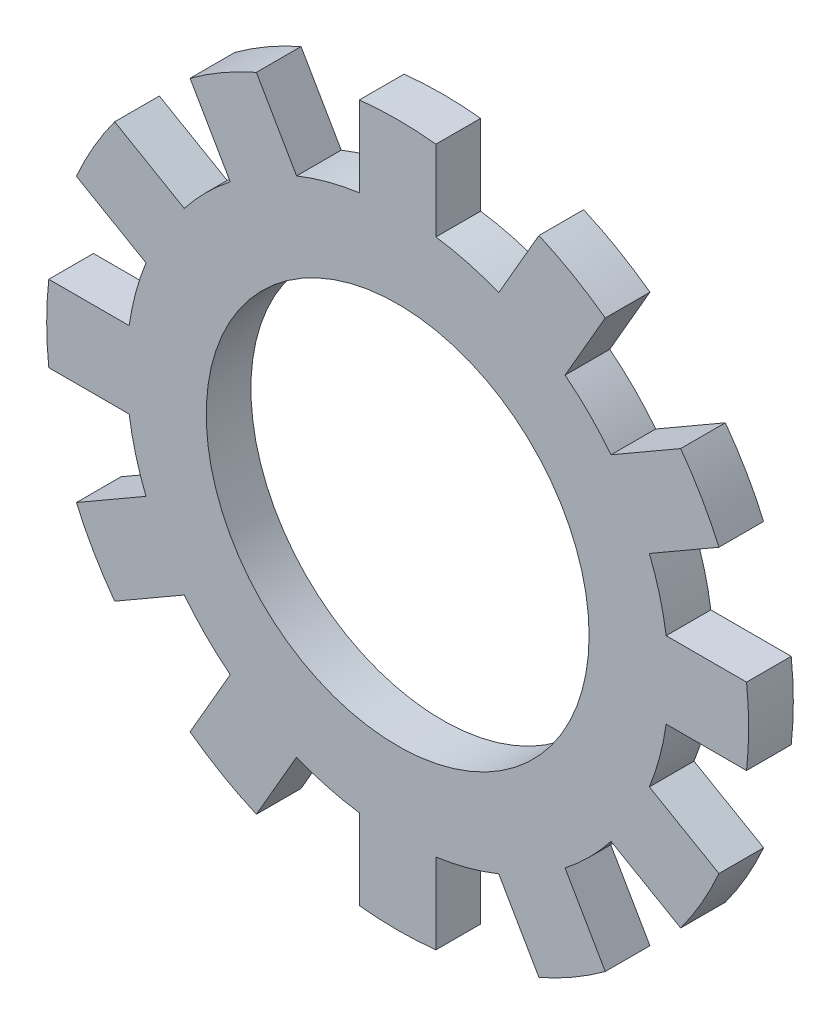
ISO-10303-21;
HEADER;
FILE_DESCRIPTION(('STEP AP214'),'2;1');
FILE_NAME('part.step','',(''),(''),'','','');
FILE_SCHEMA(('AUTOMOTIVE_DESIGN { 1 0 10303 214 1 1 1 1 }'));
ENDSEC;
DATA;
#1=APPLICATION_CONTEXT('core data for automotive mechanical design processes');
#2=APPLICATION_PROTOCOL_DEFINITION('international standard','automotive_design',2000,#1);
#3=PRODUCT_CONTEXT('',#1,'mechanical');
#4=PRODUCT('Part','Part','',(#3));
#5=PRODUCT_RELATED_PRODUCT_CATEGORY('part','',(#4));
#6=PRODUCT_DEFINITION_FORMATION('','',#4);
#7=PRODUCT_DEFINITION_CONTEXT('part definition',#1,'design');
#8=PRODUCT_DEFINITION('design','',#6,#7);
#9=PRODUCT_DEFINITION_SHAPE('','',#8);
#10=(LENGTH_UNIT() NAMED_UNIT(*) SI_UNIT(.MILLI.,.METRE.));
#11=(NAMED_UNIT(*) PLANE_ANGLE_UNIT() SI_UNIT($,.RADIAN.));
#12=(NAMED_UNIT(*) SI_UNIT($,.STERADIAN.) SOLID_ANGLE_UNIT());
#13=UNCERTAINTY_MEASURE_WITH_UNIT(LENGTH_MEASURE(1.E-05),#10,'distance_accuracy_value','');
#14=(GEOMETRIC_REPRESENTATION_CONTEXT(3) GLOBAL_UNCERTAINTY_ASSIGNED_CONTEXT((#13)) GLOBAL_UNIT_ASSIGNED_CONTEXT((#10,
#11,#12)) REPRESENTATION_CONTEXT('',''));
#15=CARTESIAN_POINT('',(0.,0.,0.));
#16=DIRECTION('',(0.,0.,1.));
#17=DIRECTION('',(1.,0.,0.));
#18=AXIS2_PLACEMENT_3D('',#15,#16,#17);
#19=CARTESIAN_POINT('',(0.,0.,0.35));
#20=DIRECTION('',(0.,0.,-1.));
#21=DIRECTION('',(-1.,0.,0.));
#22=AXIS2_PLACEMENT_3D('',#19,#20,#21);
#23=CYLINDRICAL_SURFACE('',#22,4.25);
#24=CARTESIAN_POINT('',(0.,0.,-0.35));
#25=DIRECTION('',(0.,0.,1.));
#26=DIRECTION('',(1.,0.,0.));
#27=AXIS2_PLACEMENT_3D('',#24,#25,#26);
#28=CIRCLE('',#27,4.25);
#29=CARTESIAN_POINT('',(3.3437446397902,2.62333219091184,-0.35));
#30=VERTEX_POINT('',#29);
#31=CARTESIAN_POINT('',(2.62333219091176,3.34374463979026,-0.35));
#32=VERTEX_POINT('',#31);
#33=EDGE_CURVE('E361',#30,#32,#28,.T.);
#34=ORIENTED_EDGE('',*,*,#33,.T.);
#35=DIRECTION('',(0.,0.,-1.));
#36=VECTOR('',#35,1.);
#37=CARTESIAN_POINT('',(2.62333219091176,3.34374463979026,0.35));
#38=LINE('',#37,#36);
#39=CARTESIAN_POINT('',(2.62333219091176,3.34374463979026,0.35));
#40=VERTEX_POINT('',#39);
#41=EDGE_CURVE('E352',#40,#32,#38,.T.);
#42=ORIENTED_EDGE('',*,*,#41,.F.);
#43=CARTESIAN_POINT('',(0.,0.,0.35));
#44=DIRECTION('',(0.,0.,1.));
#45=DIRECTION('',(1.,0.,0.));
#46=AXIS2_PLACEMENT_3D('',#43,#44,#45);
#47=CIRCLE('',#46,4.25);
#48=CARTESIAN_POINT('',(3.3437446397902,2.62333219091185,0.35));
#49=VERTEX_POINT('',#48);
#50=EDGE_CURVE('E64',#49,#40,#47,.T.);
#51=ORIENTED_EDGE('',*,*,#50,.F.);
#52=DIRECTION('',(0.,0.,-1.));
#53=VECTOR('',#52,1.);
#54=CARTESIAN_POINT('',(3.3437446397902,2.62333219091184,0.35));
#55=LINE('',#54,#53);
#56=EDGE_CURVE('E627',#49,#30,#55,.T.);
#57=ORIENTED_EDGE('',*,*,#56,.T.);
#58=EDGE_LOOP('',(#34,#42,#51,#57));
#59=FACE_BOUND('',#58,.T.);
#60=ADVANCED_FACE('F39',(#59),#23,.T.);
#61=DIRECTION('',(0.,0.,-1.));
#62=VECTOR('',#61,1.);
#63=CARTESIAN_POINT('',(1.58410170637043,3.94374463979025,0.35));
#64=LINE('',#63,#62);
#65=CARTESIAN_POINT('',(1.58410170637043,3.94374463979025,0.35));
#66=VERTEX_POINT('',#65);
#67=CARTESIAN_POINT('',(1.58410170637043,3.94374463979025,-0.35));
#68=VERTEX_POINT('',#67);
#69=EDGE_CURVE('E646',#66,#68,#64,.T.);
#70=ORIENTED_EDGE('',*,*,#69,.T.);
#71=CARTESIAN_POINT('',(0.6,4.20743389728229,-0.35));
#72=VERTEX_POINT('',#71);
#73=EDGE_CURVE('E388',#68,#72,#28,.T.);
#74=ORIENTED_EDGE('',*,*,#73,.T.);
#75=DIRECTION('',(0.,0.,-1.));
#76=VECTOR('',#75,1.);
#77=CARTESIAN_POINT('',(0.6,4.20743389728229,0.35));
#78=LINE('',#77,#76);
#79=CARTESIAN_POINT('',(0.6,4.20743389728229,0.35));
#80=VERTEX_POINT('',#79);
#81=EDGE_CURVE('E405',#80,#72,#78,.T.);
#82=ORIENTED_EDGE('',*,*,#81,.F.);
#83=EDGE_CURVE('E50',#66,#80,#47,.T.);
#84=ORIENTED_EDGE('',*,*,#83,.F.);
#85=EDGE_LOOP('',(#70,#74,#82,#84));
#86=FACE_BOUND('',#85,.T.);
#87=ADVANCED_FACE('F817',(#86),#23,.T.);
#88=CARTESIAN_POINT('',(4.20743389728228,0.600000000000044,-0.35));
#89=VERTEX_POINT('',#88);
#90=CARTESIAN_POINT('',(3.94374463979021,1.58410170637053,-0.35));
#91=VERTEX_POINT('',#90);
#92=EDGE_CURVE('E907',#89,#91,#28,.T.);
#93=ORIENTED_EDGE('',*,*,#92,.T.);
#94=DIRECTION('',(0.,0.,-1.));
#95=VECTOR('',#94,1.);
#96=CARTESIAN_POINT('',(3.94374463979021,1.58410170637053,0.35));
#97=LINE('',#96,#95);
#98=CARTESIAN_POINT('',(3.94374463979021,1.58410170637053,0.35));
#99=VERTEX_POINT('',#98);
#100=EDGE_CURVE('E786',#99,#91,#97,.T.);
#101=ORIENTED_EDGE('',*,*,#100,.F.);
#102=CARTESIAN_POINT('',(4.20743389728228,0.600000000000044,0.35));
#103=VERTEX_POINT('',#102);
#104=EDGE_CURVE('E371',#103,#99,#47,.T.);
#105=ORIENTED_EDGE('',*,*,#104,.F.);
#106=DIRECTION('',(0.,0.,-1.));
#107=VECTOR('',#106,1.);
#108=CARTESIAN_POINT('',(4.20743389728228,0.600000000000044,0.35));
#109=LINE('',#108,#107);
#110=EDGE_CURVE('E605',#103,#89,#109,.T.);
#111=ORIENTED_EDGE('',*,*,#110,.T.);
#112=EDGE_LOOP('',(#93,#101,#105,#111));
#113=FACE_BOUND('',#112,.T.);
#114=ADVANCED_FACE('F905',(#113),#23,.T.);
#115=CARTESIAN_POINT('',(3.94374463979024,-1.58410170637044,-0.35));
#116=VERTEX_POINT('',#115);
#117=CARTESIAN_POINT('',(4.20743389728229,-0.599999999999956,-0.35));
#118=VERTEX_POINT('',#117);
#119=EDGE_CURVE('E888',#116,#118,#28,.T.);
#120=ORIENTED_EDGE('',*,*,#119,.T.);
#121=DIRECTION('',(0.,0.,-1.));
#122=VECTOR('',#121,1.);
#123=CARTESIAN_POINT('',(4.20743389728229,-0.599999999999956,0.35));
#124=LINE('',#123,#122);
#125=CARTESIAN_POINT('',(4.20743389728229,-0.599999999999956,0.35));
#126=VERTEX_POINT('',#125);
#127=EDGE_CURVE('E772',#126,#118,#124,.T.);
#128=ORIENTED_EDGE('',*,*,#127,.F.);
#129=CARTESIAN_POINT('',(3.94374463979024,-1.58410170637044,0.35));
#130=VERTEX_POINT('',#129);
#131=EDGE_CURVE('E376',#130,#126,#47,.T.);
#132=ORIENTED_EDGE('',*,*,#131,.F.);
#133=DIRECTION('',(0.,0.,-1.));
#134=VECTOR('',#133,1.);
#135=CARTESIAN_POINT('',(3.94374463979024,-1.58410170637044,0.35));
#136=LINE('',#135,#134);
#137=EDGE_CURVE('E583',#130,#116,#136,.T.);
#138=ORIENTED_EDGE('',*,*,#137,.T.);
#139=EDGE_LOOP('',(#120,#128,#132,#138));
#140=FACE_BOUND('',#139,.T.);
#141=ADVANCED_FACE('F887',(#140),#23,.T.);
#142=CARTESIAN_POINT('',(2.62333219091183,-3.3437446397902,-0.35));
#143=VERTEX_POINT('',#142);
#144=CARTESIAN_POINT('',(3.34374463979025,-2.62333219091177,-0.35));
#145=VERTEX_POINT('',#144);
#146=EDGE_CURVE('E965',#143,#145,#28,.T.);
#147=ORIENTED_EDGE('',*,*,#146,.T.);
#148=DIRECTION('',(0.,0.,-1.));
#149=VECTOR('',#148,1.);
#150=CARTESIAN_POINT('',(3.34374463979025,-2.62333219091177,0.35));
#151=LINE('',#150,#149);
#152=CARTESIAN_POINT('',(3.34374463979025,-2.62333219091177,0.35));
#153=VERTEX_POINT('',#152);
#154=EDGE_CURVE('E758',#153,#145,#151,.T.);
#155=ORIENTED_EDGE('',*,*,#154,.F.);
#156=CARTESIAN_POINT('',(2.62333219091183,-3.34374463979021,0.35));
#157=VERTEX_POINT('',#156);
#158=EDGE_CURVE('E873',#157,#153,#47,.T.);
#159=ORIENTED_EDGE('',*,*,#158,.F.);
#160=DIRECTION('',(0.,0.,-1.));
#161=VECTOR('',#160,1.);
#162=CARTESIAN_POINT('',(2.62333219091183,-3.3437446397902,0.35));
#163=LINE('',#162,#161);
#164=EDGE_CURVE('E561',#157,#143,#163,.T.);
#165=ORIENTED_EDGE('',*,*,#164,.T.);
#166=EDGE_LOOP('',(#147,#155,#159,#165));
#167=FACE_BOUND('',#166,.T.);
#168=ADVANCED_FACE('F974',(#167),#23,.T.);
#169=CARTESIAN_POINT('',(0.6,-4.20743389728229,-0.35));
#170=VERTEX_POINT('',#169);
#171=CARTESIAN_POINT('',(1.58410170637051,-3.94374463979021,-0.35));
#172=VERTEX_POINT('',#171);
#173=EDGE_CURVE('E961',#170,#172,#28,.T.);
#174=ORIENTED_EDGE('',*,*,#173,.T.);
#175=DIRECTION('',(0.,0.,-1.));
#176=VECTOR('',#175,1.);
#177=CARTESIAN_POINT('',(1.58410170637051,-3.94374463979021,0.35));
#178=LINE('',#177,#176);
#179=CARTESIAN_POINT('',(1.58410170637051,-3.94374463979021,0.35));
#180=VERTEX_POINT('',#179);
#181=EDGE_CURVE('E744',#180,#172,#178,.T.);
#182=ORIENTED_EDGE('',*,*,#181,.F.);
#183=CARTESIAN_POINT('',(0.6,-4.20743389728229,0.35));
#184=VERTEX_POINT('',#183);
#185=EDGE_CURVE('E869',#184,#180,#47,.T.);
#186=ORIENTED_EDGE('',*,*,#185,.F.);
#187=DIRECTION('',(0.,0.,-1.));
#188=VECTOR('',#187,1.);
#189=CARTESIAN_POINT('',(0.6,-4.20743389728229,0.35));
#190=LINE('',#189,#188);
#191=EDGE_CURVE('E539',#184,#170,#190,.T.);
#192=ORIENTED_EDGE('',*,*,#191,.T.);
#193=EDGE_LOOP('',(#174,#182,#186,#192));
#194=FACE_BOUND('',#193,.T.);
#195=ADVANCED_FACE('F1402',(#194),#23,.T.);
#196=CARTESIAN_POINT('',(-1.58410170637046,-3.94374463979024,-0.35));
#197=VERTEX_POINT('',#196);
#198=CARTESIAN_POINT('',(-0.6,-4.20743389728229,-0.35));
#199=VERTEX_POINT('',#198);
#200=EDGE_CURVE('E956',#197,#199,#28,.T.);
#201=ORIENTED_EDGE('',*,*,#200,.T.);
#202=DIRECTION('',(0.,0.,-1.));
#203=VECTOR('',#202,1.);
#204=CARTESIAN_POINT('',(-0.6,-4.20743389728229,0.35));
#205=LINE('',#204,#203);
#206=CARTESIAN_POINT('',(-0.6,-4.20743389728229,0.35));
#207=VERTEX_POINT('',#206);
#208=EDGE_CURVE('E730',#207,#199,#205,.T.);
#209=ORIENTED_EDGE('',*,*,#208,.F.);
#210=CARTESIAN_POINT('',(-1.58410170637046,-3.94374463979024,0.35));
#211=VERTEX_POINT('',#210);
#212=EDGE_CURVE('E865',#211,#207,#47,.T.);
#213=ORIENTED_EDGE('',*,*,#212,.F.);
#214=DIRECTION('',(0.,0.,-1.));
#215=VECTOR('',#214,1.);
#216=CARTESIAN_POINT('',(-1.58410170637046,-3.94374463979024,0.35));
#217=LINE('',#216,#215);
#218=EDGE_CURVE('E517',#211,#197,#217,.T.);
#219=ORIENTED_EDGE('',*,*,#218,.T.);
#220=EDGE_LOOP('',(#201,#209,#213,#219));
#221=FACE_BOUND('',#220,.T.);
#222=ADVANCED_FACE('F1394',(#221),#23,.T.);
#223=CARTESIAN_POINT('',(-3.34374463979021,-2.62333219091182,-0.35));
#224=VERTEX_POINT('',#223);
#225=CARTESIAN_POINT('',(-2.62333219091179,-3.34374463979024,-0.35));
#226=VERTEX_POINT('',#225);
#227=EDGE_CURVE('E951',#224,#226,#28,.T.);
#228=ORIENTED_EDGE('',*,*,#227,.T.);
#229=DIRECTION('',(0.,0.,-1.));
#230=VECTOR('',#229,1.);
#231=CARTESIAN_POINT('',(-2.62333219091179,-3.34374463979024,0.35));
#232=LINE('',#231,#230);
#233=CARTESIAN_POINT('',(-2.62333219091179,-3.34374463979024,0.35));
#234=VERTEX_POINT('',#233);
#235=EDGE_CURVE('E716',#234,#226,#232,.T.);
#236=ORIENTED_EDGE('',*,*,#235,.F.);
#237=CARTESIAN_POINT('',(-3.34374463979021,-2.62333219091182,0.35));
#238=VERTEX_POINT('',#237);
#239=EDGE_CURVE('E860',#238,#234,#47,.T.);
#240=ORIENTED_EDGE('',*,*,#239,.F.);
#241=DIRECTION('',(0.,0.,-1.));
#242=VECTOR('',#241,1.);
#243=CARTESIAN_POINT('',(-3.34374463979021,-2.62333219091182,0.35));
#244=LINE('',#243,#242);
#245=EDGE_CURVE('E495',#238,#224,#244,.T.);
#246=ORIENTED_EDGE('',*,*,#245,.T.);
#247=EDGE_LOOP('',(#228,#236,#240,#246));
#248=FACE_BOUND('',#247,.T.);
#249=ADVANCED_FACE('F1386',(#248),#23,.T.);
#250=CARTESIAN_POINT('',(-4.20743389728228,-0.600000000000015,-0.35));
#251=VERTEX_POINT('',#250);
#252=CARTESIAN_POINT('',(-3.94374463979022,-1.5841017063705,-0.35));
#253=VERTEX_POINT('',#252);
#254=EDGE_CURVE('E947',#251,#253,#28,.T.);
#255=ORIENTED_EDGE('',*,*,#254,.T.);
#256=DIRECTION('',(0.,0.,-1.));
#257=VECTOR('',#256,1.);
#258=CARTESIAN_POINT('',(-3.94374463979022,-1.5841017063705,0.35));
#259=LINE('',#258,#257);
#260=CARTESIAN_POINT('',(-3.94374463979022,-1.5841017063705,0.35));
#261=VERTEX_POINT('',#260);
#262=EDGE_CURVE('E702',#261,#253,#259,.T.);
#263=ORIENTED_EDGE('',*,*,#262,.F.);
#264=CARTESIAN_POINT('',(-4.20743389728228,-0.600000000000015,0.35));
#265=VERTEX_POINT('',#264);
#266=EDGE_CURVE('E856',#265,#261,#47,.T.);
#267=ORIENTED_EDGE('',*,*,#266,.F.);
#268=DIRECTION('',(0.,0.,-1.));
#269=VECTOR('',#268,1.);
#270=CARTESIAN_POINT('',(-4.20743389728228,-0.600000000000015,0.35));
#271=LINE('',#270,#269);
#272=EDGE_CURVE('E474',#265,#251,#271,.T.);
#273=ORIENTED_EDGE('',*,*,#272,.T.);
#274=EDGE_LOOP('',(#255,#263,#267,#273));
#275=FACE_BOUND('',#274,.T.);
#276=ADVANCED_FACE('F940',(#275),#23,.T.);
#277=CARTESIAN_POINT('',(-3.94374463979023,1.58410170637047,-0.35));
#278=VERTEX_POINT('',#277);
#279=CARTESIAN_POINT('',(-4.20743389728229,0.599999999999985,-0.35));
#280=VERTEX_POINT('',#279);
#281=EDGE_CURVE('E944',#278,#280,#28,.T.);
#282=ORIENTED_EDGE('',*,*,#281,.T.);
#283=DIRECTION('',(0.,0.,-1.));
#284=VECTOR('',#283,1.);
#285=CARTESIAN_POINT('',(-4.20743389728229,0.599999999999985,0.35));
#286=LINE('',#285,#284);
#287=CARTESIAN_POINT('',(-4.20743389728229,0.599999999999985,0.35));
#288=VERTEX_POINT('',#287);
#289=EDGE_CURVE('E688',#288,#280,#286,.T.);
#290=ORIENTED_EDGE('',*,*,#289,.F.);
#291=CARTESIAN_POINT('',(-3.94374463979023,1.58410170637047,0.35));
#292=VERTEX_POINT('',#291);
#293=EDGE_CURVE('E852',#292,#288,#47,.T.);
#294=ORIENTED_EDGE('',*,*,#293,.F.);
#295=DIRECTION('',(0.,0.,-1.));
#296=VECTOR('',#295,1.);
#297=CARTESIAN_POINT('',(-3.94374463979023,1.58410170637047,0.35));
#298=LINE('',#297,#296);
#299=EDGE_CURVE('E452',#292,#278,#298,.T.);
#300=ORIENTED_EDGE('',*,*,#299,.T.);
#301=EDGE_LOOP('',(#282,#290,#294,#300));
#302=FACE_BOUND('',#301,.T.);
#303=ADVANCED_FACE('F936',(#302),#23,.T.);
#304=CARTESIAN_POINT('',(-2.62333219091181,3.34374463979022,-0.35));
#305=VERTEX_POINT('',#304);
#306=CARTESIAN_POINT('',(-3.34374463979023,2.6233321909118,-0.35));
#307=VERTEX_POINT('',#306);
#308=EDGE_CURVE('E943',#305,#307,#28,.T.);
#309=ORIENTED_EDGE('',*,*,#308,.T.);
#310=DIRECTION('',(0.,0.,-1.));
#311=VECTOR('',#310,1.);
#312=CARTESIAN_POINT('',(-3.34374463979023,2.6233321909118,0.35));
#313=LINE('',#312,#311);
#314=CARTESIAN_POINT('',(-3.34374463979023,2.6233321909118,0.35));
#315=VERTEX_POINT('',#314);
#316=EDGE_CURVE('E674',#315,#307,#313,.T.);
#317=ORIENTED_EDGE('',*,*,#316,.F.);
#318=CARTESIAN_POINT('',(-2.62333219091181,3.34374463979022,0.35));
#319=VERTEX_POINT('',#318);
#320=EDGE_CURVE('E49',#319,#315,#47,.T.);
#321=ORIENTED_EDGE('',*,*,#320,.F.);
#322=DIRECTION('',(0.,0.,-1.));
#323=VECTOR('',#322,1.);
#324=CARTESIAN_POINT('',(-2.62333219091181,3.34374463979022,0.35));
#325=LINE('',#324,#323);
#326=EDGE_CURVE('E430',#319,#305,#325,.T.);
#327=ORIENTED_EDGE('',*,*,#326,.T.);
#328=EDGE_LOOP('',(#309,#317,#321,#327));
#329=FACE_BOUND('',#328,.T.);
#330=ADVANCED_FACE('F930',(#329),#23,.T.);
#331=CARTESIAN_POINT('',(-0.6,4.20743389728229,-0.35));
#332=VERTEX_POINT('',#331);
#333=CARTESIAN_POINT('',(-1.58410170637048,3.94374463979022,-0.35));
#334=VERTEX_POINT('',#333);
#335=EDGE_CURVE('E43',#332,#334,#28,.T.);
#336=ORIENTED_EDGE('',*,*,#335,.T.);
#337=DIRECTION('',(0.,0.,-1.));
#338=VECTOR('',#337,1.);
#339=CARTESIAN_POINT('',(-1.58410170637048,3.94374463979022,0.35));
#340=LINE('',#339,#338);
#341=CARTESIAN_POINT('',(-1.58410170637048,3.94374463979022,0.35));
#342=VERTEX_POINT('',#341);
#343=EDGE_CURVE('E658',#342,#334,#340,.T.);
#344=ORIENTED_EDGE('',*,*,#343,.F.);
#345=CARTESIAN_POINT('',(-0.6,4.20743389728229,0.35));
#346=VERTEX_POINT('',#345);
#347=EDGE_CURVE('E11',#346,#342,#47,.T.);
#348=ORIENTED_EDGE('',*,*,#347,.F.);
#349=DIRECTION('',(0.,0.,-1.));
#350=VECTOR('',#349,1.);
#351=CARTESIAN_POINT('',(-0.6,4.20743389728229,0.35));
#352=LINE('',#351,#350);
#353=EDGE_CURVE('E392',#346,#332,#352,.T.);
#354=ORIENTED_EDGE('',*,*,#353,.T.);
#355=EDGE_LOOP('',(#336,#344,#348,#354));
#356=FACE_BOUND('',#355,.T.);
#357=ADVANCED_FACE('F41',(#356),#23,.T.);
#358=CARTESIAN_POINT('',(0.,0.,0.35));
#359=DIRECTION('',(0.,0.,1.));
#360=DIRECTION('',(1.,0.,0.));
#361=AXIS2_PLACEMENT_3D('',#358,#359,#360);
#362=PLANE('',#361);
#363=ORIENTED_EDGE('',*,*,#347,.T.);
#364=DIRECTION('',(0.500000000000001,-0.866025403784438,0.));
#365=VECTOR('',#364,1.);
#366=CARTESIAN_POINT('',(-2.21397214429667,5.03471224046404,0.35));
#367=LINE('',#366,#365);
#368=CARTESIAN_POINT('',(-2.21397214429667,5.03471224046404,0.35));
#369=VERTEX_POINT('',#368);
#370=EDGE_CURVE('E669',#369,#342,#367,.T.);
#371=ORIENTED_EDGE('',*,*,#370,.F.);
#372=CARTESIAN_POINT('',(0.,0.,0.35));
#373=DIRECTION('',(0.,0.,1.));
#374=DIRECTION('',(0.866025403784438,0.500000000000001,0.));
#375=AXIS2_PLACEMENT_3D('',#372,#373,#374);
#376=CIRCLE('',#375,5.5);
#377=CARTESIAN_POINT('',(-3.253202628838,4.43471224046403,0.35));
#378=VERTEX_POINT('',#377);
#379=EDGE_CURVE('E439',#369,#378,#376,.T.);
#380=ORIENTED_EDGE('',*,*,#379,.T.);
#381=DIRECTION('',(0.500000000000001,-0.866025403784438,0.));
#382=VECTOR('',#381,1.);
#383=CARTESIAN_POINT('',(-3.253202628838,4.43471224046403,0.35));
#384=LINE('',#383,#382);
#385=EDGE_CURVE('E434',#378,#319,#384,.T.);
#386=ORIENTED_EDGE('',*,*,#385,.T.);
#387=ORIENTED_EDGE('',*,*,#320,.T.);
#388=DIRECTION('',(0.86602540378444,-0.499999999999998,0.));
#389=VECTOR('',#388,1.);
#390=CARTESIAN_POINT('',(-4.43471224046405,3.25320262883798,0.35));
#391=LINE('',#390,#389);
#392=CARTESIAN_POINT('',(-4.43471224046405,3.25320262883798,0.35));
#393=VERTEX_POINT('',#392);
#394=EDGE_CURVE('E683',#393,#315,#391,.T.);
#395=ORIENTED_EDGE('',*,*,#394,.F.);
#396=CARTESIAN_POINT('',(0.,0.,0.35));
#397=DIRECTION('',(0.,0.,1.));
#398=DIRECTION('',(0.499999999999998,0.86602540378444,0.));
#399=AXIS2_PLACEMENT_3D('',#396,#397,#398);
#400=CIRCLE('',#399,5.5);
#401=CARTESIAN_POINT('',(-5.03471224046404,2.21397214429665,0.35));
#402=VERTEX_POINT('',#401);
#403=EDGE_CURVE('E461',#393,#402,#400,.T.);
#404=ORIENTED_EDGE('',*,*,#403,.T.);
#405=DIRECTION('',(0.86602540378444,-0.499999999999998,0.));
#406=VECTOR('',#405,1.);
#407=CARTESIAN_POINT('',(-5.03471224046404,2.21397214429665,0.35));
#408=LINE('',#407,#406);
#409=EDGE_CURVE('E456',#402,#292,#408,.T.);
#410=ORIENTED_EDGE('',*,*,#409,.T.);
#411=ORIENTED_EDGE('',*,*,#293,.T.);
#412=DIRECTION('',(1.,0.,0.));
#413=VECTOR('',#412,1.);
#414=CARTESIAN_POINT('',(-5.46717477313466,0.599999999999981,0.35));
#415=LINE('',#414,#413);
#416=CARTESIAN_POINT('',(-5.46717477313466,0.599999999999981,0.35));
#417=VERTEX_POINT('',#416);
#418=EDGE_CURVE('E697',#417,#288,#415,.T.);
#419=ORIENTED_EDGE('',*,*,#418,.F.);
#420=CARTESIAN_POINT('',(0.,0.,0.35));
#421=DIRECTION('',(0.,0.,1.));
#422=DIRECTION('',(0.,1.,0.));
#423=AXIS2_PLACEMENT_3D('',#420,#421,#422);
#424=CIRCLE('',#423,5.5);
#425=CARTESIAN_POINT('',(-5.46717477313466,-0.60000000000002,0.35));
#426=VERTEX_POINT('',#425);
#427=EDGE_CURVE('E483',#417,#426,#424,.T.);
#428=ORIENTED_EDGE('',*,*,#427,.T.);
#429=DIRECTION('',(1.,0.,0.));
#430=VECTOR('',#429,1.);
#431=CARTESIAN_POINT('',(-5.46717477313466,-0.600000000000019,0.35));
#432=LINE('',#431,#430);
#433=EDGE_CURVE('E478',#426,#265,#432,.T.);
#434=ORIENTED_EDGE('',*,*,#433,.T.);
#435=ORIENTED_EDGE('',*,*,#266,.T.);
#436=DIRECTION('',(0.866025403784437,0.500000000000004,0.));
#437=VECTOR('',#436,1.);
#438=CARTESIAN_POINT('',(-5.03471224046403,-2.21397214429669,0.35));
#439=LINE('',#438,#437);
#440=CARTESIAN_POINT('',(-5.03471224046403,-2.21397214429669,0.35));
#441=VERTEX_POINT('',#440);
#442=EDGE_CURVE('E711',#441,#261,#439,.T.);
#443=ORIENTED_EDGE('',*,*,#442,.F.);
#444=CARTESIAN_POINT('',(0.,0.,0.35));
#445=DIRECTION('',(0.,0.,1.));
#446=DIRECTION('',(-0.500000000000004,0.866025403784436,0.));
#447=AXIS2_PLACEMENT_3D('',#444,#445,#446);
#448=CIRCLE('',#447,5.5);
#449=CARTESIAN_POINT('',(-4.43471224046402,-3.25320262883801,0.35));
#450=VERTEX_POINT('',#449);
#451=EDGE_CURVE('E504',#441,#450,#448,.T.);
#452=ORIENTED_EDGE('',*,*,#451,.T.);
#453=DIRECTION('',(0.866025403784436,0.500000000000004,0.));
#454=VECTOR('',#453,1.);
#455=CARTESIAN_POINT('',(-4.43471224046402,-3.25320262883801,0.35));
#456=LINE('',#455,#454);
#457=EDGE_CURVE('E499',#450,#238,#456,.T.);
#458=ORIENTED_EDGE('',*,*,#457,.T.);
#459=ORIENTED_EDGE('',*,*,#239,.T.);
#460=DIRECTION('',(0.499999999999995,0.866025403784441,0.));
#461=VECTOR('',#460,1.);
#462=CARTESIAN_POINT('',(-3.25320262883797,-4.43471224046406,0.35));
#463=LINE('',#462,#461);
#464=CARTESIAN_POINT('',(-3.25320262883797,-4.43471224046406,0.35));
#465=VERTEX_POINT('',#464);
#466=EDGE_CURVE('E725',#465,#234,#463,.T.);
#467=ORIENTED_EDGE('',*,*,#466,.F.);
#468=CARTESIAN_POINT('',(0.,0.,0.35));
#469=DIRECTION('',(0.,0.,1.));
#470=DIRECTION('',(-0.866025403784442,0.499999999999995,0.));
#471=AXIS2_PLACEMENT_3D('',#468,#469,#470);
#472=CIRCLE('',#471,5.5);
#473=CARTESIAN_POINT('',(-2.21397214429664,-5.03471224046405,0.35));
#474=VERTEX_POINT('',#473);
#475=EDGE_CURVE('E526',#465,#474,#472,.T.);
#476=ORIENTED_EDGE('',*,*,#475,.T.);
#477=DIRECTION('',(0.499999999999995,0.866025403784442,0.));
#478=VECTOR('',#477,1.);
#479=CARTESIAN_POINT('',(-2.21397214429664,-5.03471224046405,0.35));
#480=LINE('',#479,#478);
#481=EDGE_CURVE('E521',#474,#211,#480,.T.);
#482=ORIENTED_EDGE('',*,*,#481,.T.);
#483=ORIENTED_EDGE('',*,*,#212,.T.);
#484=DIRECTION('',(0.,1.,0.));
#485=VECTOR('',#484,1.);
#486=CARTESIAN_POINT('',(-0.6,-5.46717477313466,0.35));
#487=LINE('',#486,#485);
#488=CARTESIAN_POINT('',(-0.600000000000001,-5.46717477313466,0.35));
#489=VERTEX_POINT('',#488);
#490=EDGE_CURVE('E739',#489,#207,#487,.T.);
#491=ORIENTED_EDGE('',*,*,#490,.F.);
#492=CARTESIAN_POINT('',(0.,0.,0.35));
#493=DIRECTION('',(0.,0.,1.));
#494=DIRECTION('',(-1.,0.,0.));
#495=AXIS2_PLACEMENT_3D('',#492,#493,#494);
#496=CIRCLE('',#495,5.5);
#497=CARTESIAN_POINT('',(0.600000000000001,-5.46717477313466,0.35));
#498=VERTEX_POINT('',#497);
#499=EDGE_CURVE('E548',#489,#498,#496,.T.);
#500=ORIENTED_EDGE('',*,*,#499,.T.);
#501=DIRECTION('',(0.,1.,0.));
#502=VECTOR('',#501,1.);
#503=CARTESIAN_POINT('',(0.6,-5.46717477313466,0.35));
#504=LINE('',#503,#502);
#505=EDGE_CURVE('E543',#498,#184,#504,.T.);
#506=ORIENTED_EDGE('',*,*,#505,.T.);
#507=ORIENTED_EDGE('',*,*,#185,.T.);
#508=DIRECTION('',(-0.500000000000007,0.866025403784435,0.));
#509=VECTOR('',#508,1.);
#510=CARTESIAN_POINT('',(2.21397214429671,-5.03471224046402,0.35));
#511=LINE('',#510,#509);
#512=CARTESIAN_POINT('',(2.21397214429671,-5.03471224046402,0.35));
#513=VERTEX_POINT('',#512);
#514=EDGE_CURVE('E753',#513,#180,#511,.T.);
#515=ORIENTED_EDGE('',*,*,#514,.F.);
#516=CARTESIAN_POINT('',(0.,0.,0.35));
#517=DIRECTION('',(0.,0.,1.));
#518=DIRECTION('',(-0.866025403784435,-0.500000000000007,0.));
#519=AXIS2_PLACEMENT_3D('',#516,#517,#518);
#520=CIRCLE('',#519,5.5);
#521=CARTESIAN_POINT('',(3.25320262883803,-4.43471224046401,0.35));
#522=VERTEX_POINT('',#521);
#523=EDGE_CURVE('E570',#513,#522,#520,.T.);
#524=ORIENTED_EDGE('',*,*,#523,.T.);
#525=DIRECTION('',(-0.500000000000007,0.866025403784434,0.));
#526=VECTOR('',#525,1.);
#527=CARTESIAN_POINT('',(3.25320262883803,-4.43471224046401,0.35));
#528=LINE('',#527,#526);
#529=EDGE_CURVE('E565',#522,#157,#528,.T.);
#530=ORIENTED_EDGE('',*,*,#529,.T.);
#531=ORIENTED_EDGE('',*,*,#158,.T.);
#532=DIRECTION('',(-0.866025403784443,0.499999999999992,0.));
#533=VECTOR('',#532,1.);
#534=CARTESIAN_POINT('',(4.43471224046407,-3.25320262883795,0.35));
#535=LINE('',#534,#533);
#536=CARTESIAN_POINT('',(4.43471224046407,-3.25320262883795,0.35));
#537=VERTEX_POINT('',#536);
#538=EDGE_CURVE('E767',#537,#153,#535,.T.);
#539=ORIENTED_EDGE('',*,*,#538,.F.);
#540=CARTESIAN_POINT('',(0.,0.,0.35));
#541=DIRECTION('',(0.,0.,1.));
#542=DIRECTION('',(-0.499999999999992,-0.866025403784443,0.));
#543=AXIS2_PLACEMENT_3D('',#540,#541,#542);
#544=CIRCLE('',#543,5.5);
#545=CARTESIAN_POINT('',(5.03471224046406,-2.21397214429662,0.35));
#546=VERTEX_POINT('',#545);
#547=EDGE_CURVE('E592',#537,#546,#544,.T.);
#548=ORIENTED_EDGE('',*,*,#547,.T.);
#549=DIRECTION('',(-0.866025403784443,0.499999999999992,0.));
#550=VECTOR('',#549,1.);
#551=CARTESIAN_POINT('',(5.03471224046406,-2.21397214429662,0.35));
#552=LINE('',#551,#550);
#553=EDGE_CURVE('E587',#546,#130,#552,.T.);
#554=ORIENTED_EDGE('',*,*,#553,.T.);
#555=ORIENTED_EDGE('',*,*,#131,.T.);
#556=DIRECTION('',(-1.,0.,0.));
#557=VECTOR('',#556,1.);
#558=CARTESIAN_POINT('',(5.46717477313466,-0.599999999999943,0.35));
#559=LINE('',#558,#557);
#560=CARTESIAN_POINT('',(5.46717477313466,-0.599999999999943,0.35));
#561=VERTEX_POINT('',#560);
#562=EDGE_CURVE('E781',#561,#126,#559,.T.);
#563=ORIENTED_EDGE('',*,*,#562,.F.);
#564=CARTESIAN_POINT('',(0.,0.,0.35));
#565=DIRECTION('',(0.,0.,1.));
#566=DIRECTION('',(0.,-1.,0.));
#567=AXIS2_PLACEMENT_3D('',#564,#565,#566);
#568=CIRCLE('',#567,5.5);
#569=CARTESIAN_POINT('',(5.46717477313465,0.600000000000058,0.35));
#570=VERTEX_POINT('',#569);
#571=EDGE_CURVE('E614',#561,#570,#568,.T.);
#572=ORIENTED_EDGE('',*,*,#571,.T.);
#573=DIRECTION('',(-1.,0.,0.));
#574=VECTOR('',#573,1.);
#575=CARTESIAN_POINT('',(5.46717477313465,0.600000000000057,0.35));
#576=LINE('',#575,#574);
#577=EDGE_CURVE('E609',#570,#103,#576,.T.);
#578=ORIENTED_EDGE('',*,*,#577,.T.);
#579=ORIENTED_EDGE('',*,*,#104,.T.);
#580=DIRECTION('',(-0.866025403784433,-0.50000000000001,0.));
#581=VECTOR('',#580,1.);
#582=CARTESIAN_POINT('',(5.03471224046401,2.21397214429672,0.35));
#583=LINE('',#582,#581);
#584=CARTESIAN_POINT('',(5.03471224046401,2.21397214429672,0.35));
#585=VERTEX_POINT('',#584);
#586=EDGE_CURVE('E795',#585,#99,#583,.T.);
#587=ORIENTED_EDGE('',*,*,#586,.F.);
#588=CARTESIAN_POINT('',(0.,0.,0.35));
#589=DIRECTION('',(0.,0.,1.));
#590=DIRECTION('',(0.50000000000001,-0.866025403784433,0.));
#591=AXIS2_PLACEMENT_3D('',#588,#589,#590);
#592=CIRCLE('',#591,5.5);
#593=CARTESIAN_POINT('',(4.434712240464,3.25320262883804,0.35));
#594=VERTEX_POINT('',#593);
#595=EDGE_CURVE('E634',#585,#594,#592,.T.);
#596=ORIENTED_EDGE('',*,*,#595,.T.);
#597=DIRECTION('',(-0.866025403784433,-0.50000000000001,0.));
#598=VECTOR('',#597,1.);
#599=CARTESIAN_POINT('',(4.434712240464,3.25320262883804,0.35));
#600=LINE('',#599,#598);
#601=EDGE_CURVE('E368',#594,#49,#600,.T.);
#602=ORIENTED_EDGE('',*,*,#601,.T.);
#603=ORIENTED_EDGE('',*,*,#50,.T.);
#604=DIRECTION('',(-0.499999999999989,-0.866025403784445,0.));
#605=VECTOR('',#604,1.);
#606=CARTESIAN_POINT('',(3.25320262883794,4.43471224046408,0.35));
#607=LINE('',#606,#605);
#608=CARTESIAN_POINT('',(3.25320262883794,4.43471224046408,0.35));
#609=VERTEX_POINT('',#608);
#610=EDGE_CURVE('E349',#609,#40,#607,.T.);
#611=ORIENTED_EDGE('',*,*,#610,.F.);
#612=CARTESIAN_POINT('',(0.,0.,0.35));
#613=DIRECTION('',(0.,0.,1.));
#614=DIRECTION('',(0.866025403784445,-0.499999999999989,0.));
#615=AXIS2_PLACEMENT_3D('',#612,#613,#614);
#616=CIRCLE('',#615,5.5);
#617=CARTESIAN_POINT('',(2.2139721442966,5.03471224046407,0.35));
#618=VERTEX_POINT('',#617);
#619=EDGE_CURVE('E654',#609,#618,#616,.T.);
#620=ORIENTED_EDGE('',*,*,#619,.T.);
#621=DIRECTION('',(-0.499999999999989,-0.866025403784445,0.));
#622=VECTOR('',#621,1.);
#623=CARTESIAN_POINT('',(2.2139721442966,5.03471224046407,0.35));
#624=LINE('',#623,#622);
#625=EDGE_CURVE('E649',#618,#66,#624,.T.);
#626=ORIENTED_EDGE('',*,*,#625,.T.);
#627=ORIENTED_EDGE('',*,*,#83,.T.);
#628=DIRECTION('',(0.,-1.,0.));
#629=VECTOR('',#628,1.);
#630=CARTESIAN_POINT('',(0.6,5.46717477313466,0.35));
#631=LINE('',#630,#629);
#632=CARTESIAN_POINT('',(0.600000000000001,5.46717477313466,0.35));
#633=VERTEX_POINT('',#632);
#634=EDGE_CURVE('E418',#633,#80,#631,.T.);
#635=ORIENTED_EDGE('',*,*,#634,.F.);
#636=CARTESIAN_POINT('',(0.,0.,0.35));
#637=DIRECTION('',(0.,0.,1.));
#638=DIRECTION('',(1.,0.,0.));
#639=AXIS2_PLACEMENT_3D('',#636,#637,#638);
#640=CIRCLE('',#639,5.5);
#641=CARTESIAN_POINT('',(-0.600000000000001,5.46717477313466,0.35));
#642=VERTEX_POINT('',#641);
#643=EDGE_CURVE('E401',#633,#642,#640,.T.);
#644=ORIENTED_EDGE('',*,*,#643,.T.);
#645=DIRECTION('',(0.,-1.,0.));
#646=VECTOR('',#645,1.);
#647=CARTESIAN_POINT('',(-0.6,5.46717477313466,0.35));
#648=LINE('',#647,#646);
#649=EDGE_CURVE('E396',#642,#346,#648,.T.);
#650=ORIENTED_EDGE('',*,*,#649,.T.);
#651=EDGE_LOOP('',(#363,#371,#380,#386,#387,#395,#404,#410,#411,#419,#428,#434,#435,#443,#452,
#458,#459,#467,#476,#482,#483,#491,#500,#506,#507,#515,#524,#530,#531,#539,#548,#554,#555,#563,
#572,#578,#579,#587,#596,#602,#603,#611,#620,#626,#627,#635,#644,#650));
#652=FACE_BOUND('',#651,.T.);
#653=CARTESIAN_POINT('',(0.,0.,0.35));
#654=DIRECTION('',(0.,0.,1.));
#655=DIRECTION('',(1.,0.,0.));
#656=AXIS2_PLACEMENT_3D('',#653,#654,#655);
#657=CIRCLE('',#656,3.);
#658=CARTESIAN_POINT('',(3.,0.,0.35));
#659=VERTEX_POINT('',#658);
#660=EDGE_CURVE('E383',#659,#659,#657,.T.);
#661=ORIENTED_EDGE('',*,*,#660,.F.);
#662=EDGE_LOOP('',(#661));
#663=FACE_BOUND('',#662,.T.);
#664=ADVANCED_FACE('F365',(#652,#663),#362,.T.);
#665=CARTESIAN_POINT('',(0.,0.,-0.35));
#666=DIRECTION('',(0.,0.,1.));
#667=DIRECTION('',(1.,0.,0.));
#668=AXIS2_PLACEMENT_3D('',#665,#666,#667);
#669=PLANE('',#668);
#670=ORIENTED_EDGE('',*,*,#335,.F.);
#671=DIRECTION('',(0.,-1.,0.));
#672=VECTOR('',#671,1.);
#673=CARTESIAN_POINT('',(-0.6,5.46717477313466,-0.35));
#674=LINE('',#673,#672);
#675=CARTESIAN_POINT('',(-0.600000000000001,5.46717477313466,-0.35));
#676=VERTEX_POINT('',#675);
#677=EDGE_CURVE('E397',#676,#332,#674,.T.);
#678=ORIENTED_EDGE('',*,*,#677,.F.);
#679=CARTESIAN_POINT('',(0.,0.,-0.35));
#680=DIRECTION('',(0.,0.,1.));
#681=DIRECTION('',(1.,0.,0.));
#682=AXIS2_PLACEMENT_3D('',#679,#680,#681);
#683=CIRCLE('',#682,5.5);
#684=CARTESIAN_POINT('',(0.600000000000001,5.46717477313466,-0.35));
#685=VERTEX_POINT('',#684);
#686=EDGE_CURVE('E402',#685,#676,#683,.T.);
#687=ORIENTED_EDGE('',*,*,#686,.F.);
#688=DIRECTION('',(0.,-1.,0.));
#689=VECTOR('',#688,1.);
#690=CARTESIAN_POINT('',(0.6,5.46717477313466,-0.35));
#691=LINE('',#690,#689);
#692=EDGE_CURVE('E419',#685,#72,#691,.T.);
#693=ORIENTED_EDGE('',*,*,#692,.T.);
#694=ORIENTED_EDGE('',*,*,#73,.F.);
#695=DIRECTION('',(-0.499999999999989,-0.866025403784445,0.));
#696=VECTOR('',#695,1.);
#697=CARTESIAN_POINT('',(2.2139721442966,5.03471224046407,-0.35));
#698=LINE('',#697,#696);
#699=CARTESIAN_POINT('',(2.2139721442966,5.03471224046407,-0.35));
#700=VERTEX_POINT('',#699);
#701=EDGE_CURVE('E650',#700,#68,#698,.T.);
#702=ORIENTED_EDGE('',*,*,#701,.F.);
#703=CARTESIAN_POINT('',(0.,0.,-0.35));
#704=DIRECTION('',(0.,0.,1.));
#705=DIRECTION('',(0.866025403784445,-0.499999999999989,0.));
#706=AXIS2_PLACEMENT_3D('',#703,#704,#705);
#707=CIRCLE('',#706,5.5);
#708=CARTESIAN_POINT('',(3.25320262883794,4.43471224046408,-0.35));
#709=VERTEX_POINT('',#708);
#710=EDGE_CURVE('E655',#709,#700,#707,.T.);
#711=ORIENTED_EDGE('',*,*,#710,.F.);
#712=DIRECTION('',(-0.499999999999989,-0.866025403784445,0.));
#713=VECTOR('',#712,1.);
#714=CARTESIAN_POINT('',(3.25320262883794,4.43471224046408,-0.35));
#715=LINE('',#714,#713);
#716=EDGE_CURVE('E358',#709,#32,#715,.T.);
#717=ORIENTED_EDGE('',*,*,#716,.T.);
#718=ORIENTED_EDGE('',*,*,#33,.F.);
#719=DIRECTION('',(-0.866025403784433,-0.50000000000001,0.));
#720=VECTOR('',#719,1.);
#721=CARTESIAN_POINT('',(4.434712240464,3.25320262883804,-0.35));
#722=LINE('',#721,#720);
#723=CARTESIAN_POINT('',(4.434712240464,3.25320262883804,-0.35));
#724=VERTEX_POINT('',#723);
#725=EDGE_CURVE('E630',#724,#30,#722,.T.);
#726=ORIENTED_EDGE('',*,*,#725,.F.);
#727=CARTESIAN_POINT('',(0.,0.,-0.35));
#728=DIRECTION('',(0.,0.,1.));
#729=DIRECTION('',(0.50000000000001,-0.866025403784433,0.));
#730=AXIS2_PLACEMENT_3D('',#727,#728,#729);
#731=CIRCLE('',#730,5.5);
#732=CARTESIAN_POINT('',(5.03471224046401,2.21397214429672,-0.35));
#733=VERTEX_POINT('',#732);
#734=EDGE_CURVE('E635',#733,#724,#731,.T.);
#735=ORIENTED_EDGE('',*,*,#734,.F.);
#736=DIRECTION('',(-0.866025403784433,-0.50000000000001,0.));
#737=VECTOR('',#736,1.);
#738=CARTESIAN_POINT('',(5.03471224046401,2.21397214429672,-0.35));
#739=LINE('',#738,#737);
#740=EDGE_CURVE('E363',#733,#91,#739,.T.);
#741=ORIENTED_EDGE('',*,*,#740,.T.);
#742=ORIENTED_EDGE('',*,*,#92,.F.);
#743=DIRECTION('',(-1.,0.,0.));
#744=VECTOR('',#743,1.);
#745=CARTESIAN_POINT('',(5.46717477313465,0.600000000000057,-0.35));
#746=LINE('',#745,#744);
#747=CARTESIAN_POINT('',(5.46717477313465,0.600000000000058,-0.35));
#748=VERTEX_POINT('',#747);
#749=EDGE_CURVE('E610',#748,#89,#746,.T.);
#750=ORIENTED_EDGE('',*,*,#749,.F.);
#751=CARTESIAN_POINT('',(0.,0.,-0.35));
#752=DIRECTION('',(0.,0.,1.));
#753=DIRECTION('',(0.,-1.,0.));
#754=AXIS2_PLACEMENT_3D('',#751,#752,#753);
#755=CIRCLE('',#754,5.5);
#756=CARTESIAN_POINT('',(5.46717477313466,-0.599999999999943,-0.35));
#757=VERTEX_POINT('',#756);
#758=EDGE_CURVE('E615',#757,#748,#755,.T.);
#759=ORIENTED_EDGE('',*,*,#758,.F.);
#760=DIRECTION('',(-1.,0.,0.));
#761=VECTOR('',#760,1.);
#762=CARTESIAN_POINT('',(5.46717477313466,-0.599999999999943,-0.35));
#763=LINE('',#762,#761);
#764=EDGE_CURVE('E782',#757,#118,#763,.T.);
#765=ORIENTED_EDGE('',*,*,#764,.T.);
#766=ORIENTED_EDGE('',*,*,#119,.F.);
#767=DIRECTION('',(-0.866025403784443,0.499999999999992,0.));
#768=VECTOR('',#767,1.);
#769=CARTESIAN_POINT('',(5.03471224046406,-2.21397214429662,-0.35));
#770=LINE('',#769,#768);
#771=CARTESIAN_POINT('',(5.03471224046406,-2.21397214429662,-0.35));
#772=VERTEX_POINT('',#771);
#773=EDGE_CURVE('E588',#772,#116,#770,.T.);
#774=ORIENTED_EDGE('',*,*,#773,.F.);
#775=CARTESIAN_POINT('',(0.,0.,-0.35));
#776=DIRECTION('',(0.,0.,1.));
#777=DIRECTION('',(-0.499999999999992,-0.866025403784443,0.));
#778=AXIS2_PLACEMENT_3D('',#775,#776,#777);
#779=CIRCLE('',#778,5.5);
#780=CARTESIAN_POINT('',(4.43471224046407,-3.25320262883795,-0.35));
#781=VERTEX_POINT('',#780);
#782=EDGE_CURVE('E593',#781,#772,#779,.T.);
#783=ORIENTED_EDGE('',*,*,#782,.F.);
#784=DIRECTION('',(-0.866025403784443,0.499999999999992,0.));
#785=VECTOR('',#784,1.);
#786=CARTESIAN_POINT('',(4.43471224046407,-3.25320262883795,-0.35));
#787=LINE('',#786,#785);
#788=EDGE_CURVE('E768',#781,#145,#787,.T.);
#789=ORIENTED_EDGE('',*,*,#788,.T.);
#790=ORIENTED_EDGE('',*,*,#146,.F.);
#791=DIRECTION('',(-0.500000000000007,0.866025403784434,0.));
#792=VECTOR('',#791,1.);
#793=CARTESIAN_POINT('',(3.25320262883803,-4.43471224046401,-0.35));
#794=LINE('',#793,#792);
#795=CARTESIAN_POINT('',(3.25320262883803,-4.43471224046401,-0.35));
#796=VERTEX_POINT('',#795);
#797=EDGE_CURVE('E566',#796,#143,#794,.T.);
#798=ORIENTED_EDGE('',*,*,#797,.F.);
#799=CARTESIAN_POINT('',(0.,0.,-0.35));
#800=DIRECTION('',(0.,0.,1.));
#801=DIRECTION('',(-0.866025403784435,-0.500000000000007,0.));
#802=AXIS2_PLACEMENT_3D('',#799,#800,#801);
#803=CIRCLE('',#802,5.5);
#804=CARTESIAN_POINT('',(2.21397214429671,-5.03471224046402,-0.35));
#805=VERTEX_POINT('',#804);
#806=EDGE_CURVE('E571',#805,#796,#803,.T.);
#807=ORIENTED_EDGE('',*,*,#806,.F.);
#808=DIRECTION('',(-0.500000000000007,0.866025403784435,0.));
#809=VECTOR('',#808,1.);
#810=CARTESIAN_POINT('',(2.21397214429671,-5.03471224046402,-0.35));
#811=LINE('',#810,#809);
#812=EDGE_CURVE('E754',#805,#172,#811,.T.);
#813=ORIENTED_EDGE('',*,*,#812,.T.);
#814=ORIENTED_EDGE('',*,*,#173,.F.);
#815=DIRECTION('',(0.,1.,0.));
#816=VECTOR('',#815,1.);
#817=CARTESIAN_POINT('',(0.6,-5.46717477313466,-0.35));
#818=LINE('',#817,#816);
#819=CARTESIAN_POINT('',(0.600000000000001,-5.46717477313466,-0.35));
#820=VERTEX_POINT('',#819);
#821=EDGE_CURVE('E544',#820,#170,#818,.T.);
#822=ORIENTED_EDGE('',*,*,#821,.F.);
#823=CARTESIAN_POINT('',(0.,0.,-0.35));
#824=DIRECTION('',(0.,0.,1.));
#825=DIRECTION('',(-1.,0.,0.));
#826=AXIS2_PLACEMENT_3D('',#823,#824,#825);
#827=CIRCLE('',#826,5.5);
#828=CARTESIAN_POINT('',(-0.600000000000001,-5.46717477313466,-0.35));
#829=VERTEX_POINT('',#828);
#830=EDGE_CURVE('E549',#829,#820,#827,.T.);
#831=ORIENTED_EDGE('',*,*,#830,.F.);
#832=DIRECTION('',(0.,1.,0.));
#833=VECTOR('',#832,1.);
#834=CARTESIAN_POINT('',(-0.6,-5.46717477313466,-0.35));
#835=LINE('',#834,#833);
#836=EDGE_CURVE('E740',#829,#199,#835,.T.);
#837=ORIENTED_EDGE('',*,*,#836,.T.);
#838=ORIENTED_EDGE('',*,*,#200,.F.);
#839=DIRECTION('',(0.499999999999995,0.866025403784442,0.));
#840=VECTOR('',#839,1.);
#841=CARTESIAN_POINT('',(-2.21397214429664,-5.03471224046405,-0.35));
#842=LINE('',#841,#840);
#843=CARTESIAN_POINT('',(-2.21397214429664,-5.03471224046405,-0.35));
#844=VERTEX_POINT('',#843);
#845=EDGE_CURVE('E522',#844,#197,#842,.T.);
#846=ORIENTED_EDGE('',*,*,#845,.F.);
#847=CARTESIAN_POINT('',(0.,0.,-0.35));
#848=DIRECTION('',(0.,0.,1.));
#849=DIRECTION('',(-0.866025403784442,0.499999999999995,0.));
#850=AXIS2_PLACEMENT_3D('',#847,#848,#849);
#851=CIRCLE('',#850,5.5);
#852=CARTESIAN_POINT('',(-3.25320262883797,-4.43471224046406,-0.35));
#853=VERTEX_POINT('',#852);
#854=EDGE_CURVE('E527',#853,#844,#851,.T.);
#855=ORIENTED_EDGE('',*,*,#854,.F.);
#856=DIRECTION('',(0.499999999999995,0.866025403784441,0.));
#857=VECTOR('',#856,1.);
#858=CARTESIAN_POINT('',(-3.25320262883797,-4.43471224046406,-0.35));
#859=LINE('',#858,#857);
#860=EDGE_CURVE('E726',#853,#226,#859,.T.);
#861=ORIENTED_EDGE('',*,*,#860,.T.);
#862=ORIENTED_EDGE('',*,*,#227,.F.);
#863=DIRECTION('',(0.866025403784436,0.500000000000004,0.));
#864=VECTOR('',#863,1.);
#865=CARTESIAN_POINT('',(-4.43471224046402,-3.25320262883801,-0.35));
#866=LINE('',#865,#864);
#867=CARTESIAN_POINT('',(-4.43471224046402,-3.25320262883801,-0.35));
#868=VERTEX_POINT('',#867);
#869=EDGE_CURVE('E500',#868,#224,#866,.T.);
#870=ORIENTED_EDGE('',*,*,#869,.F.);
#871=CARTESIAN_POINT('',(0.,0.,-0.35));
#872=DIRECTION('',(0.,0.,1.));
#873=DIRECTION('',(-0.500000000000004,0.866025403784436,0.));
#874=AXIS2_PLACEMENT_3D('',#871,#872,#873);
#875=CIRCLE('',#874,5.5);
#876=CARTESIAN_POINT('',(-5.03471224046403,-2.21397214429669,-0.35));
#877=VERTEX_POINT('',#876);
#878=EDGE_CURVE('E505',#877,#868,#875,.T.);
#879=ORIENTED_EDGE('',*,*,#878,.F.);
#880=DIRECTION('',(0.866025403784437,0.500000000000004,0.));
#881=VECTOR('',#880,1.);
#882=CARTESIAN_POINT('',(-5.03471224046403,-2.21397214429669,-0.35));
#883=LINE('',#882,#881);
#884=EDGE_CURVE('E712',#877,#253,#883,.T.);
#885=ORIENTED_EDGE('',*,*,#884,.T.);
#886=ORIENTED_EDGE('',*,*,#254,.F.);
#887=DIRECTION('',(1.,0.,0.));
#888=VECTOR('',#887,1.);
#889=CARTESIAN_POINT('',(-5.46717477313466,-0.600000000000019,-0.35));
#890=LINE('',#889,#888);
#891=CARTESIAN_POINT('',(-5.46717477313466,-0.60000000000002,-0.35));
#892=VERTEX_POINT('',#891);
#893=EDGE_CURVE('E479',#892,#251,#890,.T.);
#894=ORIENTED_EDGE('',*,*,#893,.F.);
#895=CARTESIAN_POINT('',(0.,0.,-0.35));
#896=DIRECTION('',(0.,0.,1.));
#897=DIRECTION('',(0.,1.,0.));
#898=AXIS2_PLACEMENT_3D('',#895,#896,#897);
#899=CIRCLE('',#898,5.5);
#900=CARTESIAN_POINT('',(-5.46717477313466,0.599999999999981,-0.35));
#901=VERTEX_POINT('',#900);
#902=EDGE_CURVE('E484',#901,#892,#899,.T.);
#903=ORIENTED_EDGE('',*,*,#902,.F.);
#904=DIRECTION('',(1.,0.,0.));
#905=VECTOR('',#904,1.);
#906=CARTESIAN_POINT('',(-5.46717477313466,0.599999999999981,-0.35));
#907=LINE('',#906,#905);
#908=EDGE_CURVE('E698',#901,#280,#907,.T.);
#909=ORIENTED_EDGE('',*,*,#908,.T.);
#910=ORIENTED_EDGE('',*,*,#281,.F.);
#911=DIRECTION('',(0.86602540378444,-0.499999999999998,0.));
#912=VECTOR('',#911,1.);
#913=CARTESIAN_POINT('',(-5.03471224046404,2.21397214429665,-0.35));
#914=LINE('',#913,#912);
#915=CARTESIAN_POINT('',(-5.03471224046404,2.21397214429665,-0.35));
#916=VERTEX_POINT('',#915);
#917=EDGE_CURVE('E457',#916,#278,#914,.T.);
#918=ORIENTED_EDGE('',*,*,#917,.F.);
#919=CARTESIAN_POINT('',(0.,0.,-0.35));
#920=DIRECTION('',(0.,0.,1.));
#921=DIRECTION('',(0.499999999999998,0.86602540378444,0.));
#922=AXIS2_PLACEMENT_3D('',#919,#920,#921);
#923=CIRCLE('',#922,5.5);
#924=CARTESIAN_POINT('',(-4.43471224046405,3.25320262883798,-0.35));
#925=VERTEX_POINT('',#924);
#926=EDGE_CURVE('E462',#925,#916,#923,.T.);
#927=ORIENTED_EDGE('',*,*,#926,.F.);
#928=DIRECTION('',(0.86602540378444,-0.499999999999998,0.));
#929=VECTOR('',#928,1.);
#930=CARTESIAN_POINT('',(-4.43471224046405,3.25320262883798,-0.35));
#931=LINE('',#930,#929);
#932=EDGE_CURVE('E684',#925,#307,#931,.T.);
#933=ORIENTED_EDGE('',*,*,#932,.T.);
#934=ORIENTED_EDGE('',*,*,#308,.F.);
#935=DIRECTION('',(0.500000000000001,-0.866025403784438,0.));
#936=VECTOR('',#935,1.);
#937=CARTESIAN_POINT('',(-3.253202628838,4.43471224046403,-0.35));
#938=LINE('',#937,#936);
#939=CARTESIAN_POINT('',(-3.253202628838,4.43471224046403,-0.35));
#940=VERTEX_POINT('',#939);
#941=EDGE_CURVE('E435',#940,#305,#938,.T.);
#942=ORIENTED_EDGE('',*,*,#941,.F.);
#943=CARTESIAN_POINT('',(0.,0.,-0.35));
#944=DIRECTION('',(0.,0.,1.));
#945=DIRECTION('',(0.866025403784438,0.500000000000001,0.));
#946=AXIS2_PLACEMENT_3D('',#943,#944,#945);
#947=CIRCLE('',#946,5.5);
#948=CARTESIAN_POINT('',(-2.21397214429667,5.03471224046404,-0.35));
#949=VERTEX_POINT('',#948);
#950=EDGE_CURVE('E440',#949,#940,#947,.T.);
#951=ORIENTED_EDGE('',*,*,#950,.F.);
#952=DIRECTION('',(0.500000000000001,-0.866025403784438,0.));
#953=VECTOR('',#952,1.);
#954=CARTESIAN_POINT('',(-2.21397214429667,5.03471224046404,-0.35));
#955=LINE('',#954,#953);
#956=EDGE_CURVE('E670',#949,#334,#955,.T.);
#957=ORIENTED_EDGE('',*,*,#956,.T.);
#958=EDGE_LOOP('',(#670,#678,#687,#693,#694,#702,#711,#717,#718,#726,#735,#741,#742,#750,#759,
#765,#766,#774,#783,#789,#790,#798,#807,#813,#814,#822,#831,#837,#838,#846,#855,#861,#862,#870,
#879,#885,#886,#894,#903,#909,#910,#918,#927,#933,#934,#942,#951,#957));
#959=FACE_BOUND('',#958,.T.);
#960=CARTESIAN_POINT('',(0.,0.,-0.35));
#961=DIRECTION('',(0.,0.,1.));
#962=DIRECTION('',(1.,0.,0.));
#963=AXIS2_PLACEMENT_3D('',#960,#961,#962);
#964=CIRCLE('',#963,3.);
#965=CARTESIAN_POINT('',(3.,0.,-0.35));
#966=VERTEX_POINT('',#965);
#967=EDGE_CURVE('E379',#966,#966,#964,.T.);
#968=ORIENTED_EDGE('',*,*,#967,.T.);
#969=EDGE_LOOP('',(#968));
#970=FACE_BOUND('',#969,.T.);
#971=ADVANCED_FACE('F805',(#959,#970),#669,.F.);
#972=CARTESIAN_POINT('',(0.,0.,0.35));
#973=DIRECTION('',(0.,0.,-1.));
#974=DIRECTION('',(-1.,0.,0.));
#975=AXIS2_PLACEMENT_3D('',#972,#973,#974);
#976=CYLINDRICAL_SURFACE('',#975,3.);
#977=ORIENTED_EDGE('',*,*,#660,.T.);
#978=EDGE_LOOP('',(#977));
#979=FACE_BOUND('',#978,.T.);
#980=ORIENTED_EDGE('',*,*,#967,.F.);
#981=EDGE_LOOP('',(#980));
#982=FACE_BOUND('',#981,.T.);
#983=ADVANCED_FACE('F1054',(#979,#982),#976,.F.);
#984=CARTESIAN_POINT('',(0.,0.,0.35));
#985=DIRECTION('',(0.,0.,-1.));
#986=DIRECTION('',(-1.,0.,0.));
#987=AXIS2_PLACEMENT_3D('',#984,#985,#986);
#988=CYLINDRICAL_SURFACE('',#987,5.5);
#989=ORIENTED_EDGE('',*,*,#686,.T.);
#990=DIRECTION('',(0.,0.,-1.));
#991=VECTOR('',#990,1.);
#992=CARTESIAN_POINT('',(-0.600000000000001,5.46717477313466,0.35));
#993=LINE('',#992,#991);
#994=EDGE_CURVE('E384',#642,#676,#993,.T.);
#995=ORIENTED_EDGE('',*,*,#994,.F.);
#996=ORIENTED_EDGE('',*,*,#643,.F.);
#997=DIRECTION('',(0.,0.,-1.));
#998=VECTOR('',#997,1.);
#999=CARTESIAN_POINT('',(0.600000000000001,5.46717477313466,0.35));
#1000=LINE('',#999,#998);
#1001=EDGE_CURVE('E414',#633,#685,#1000,.T.);
#1002=ORIENTED_EDGE('',*,*,#1001,.T.);
#1003=EDGE_LOOP('',(#989,#995,#996,#1002));
#1004=FACE_BOUND('',#1003,.T.);
#1005=ADVANCED_FACE('F826',(#1004),#988,.T.);
#1006=CARTESIAN_POINT('',(-0.6,5.46717477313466,0.35));
#1007=DIRECTION('',(1.,0.,0.));
#1008=DIRECTION('',(0.,1.,0.));
#1009=AXIS2_PLACEMENT_3D('',#1006,#1007,#1008);
#1010=PLANE('',#1009);
#1011=ORIENTED_EDGE('',*,*,#677,.T.);
#1012=ORIENTED_EDGE('',*,*,#353,.F.);
#1013=ORIENTED_EDGE('',*,*,#649,.F.);
#1014=ORIENTED_EDGE('',*,*,#994,.T.);
#1015=EDGE_LOOP('',(#1011,#1012,#1013,#1014));
#1016=FACE_BOUND('',#1015,.T.);
#1017=ADVANCED_FACE('F830',(#1016),#1010,.F.);
#1018=CARTESIAN_POINT('',(0.6,5.46717477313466,0.35));
#1019=DIRECTION('',(1.,0.,0.));
#1020=DIRECTION('',(0.,1.,0.));
#1021=AXIS2_PLACEMENT_3D('',#1018,#1019,#1020);
#1022=PLANE('',#1021);
#1023=ORIENTED_EDGE('',*,*,#692,.F.);
#1024=ORIENTED_EDGE('',*,*,#1001,.F.);
#1025=ORIENTED_EDGE('',*,*,#634,.T.);
#1026=ORIENTED_EDGE('',*,*,#81,.T.);
#1027=EDGE_LOOP('',(#1023,#1024,#1025,#1026));
#1028=FACE_BOUND('',#1027,.T.);
#1029=ADVANCED_FACE('F821',(#1028),#1022,.T.);
#1030=CARTESIAN_POINT('',(0.,0.,0.35));
#1031=DIRECTION('',(0.,0.,-1.));
#1032=DIRECTION('',(-1.,0.,0.));
#1033=AXIS2_PLACEMENT_3D('',#1030,#1031,#1032);
#1034=CYLINDRICAL_SURFACE('',#1033,5.5);
#1035=ORIENTED_EDGE('',*,*,#950,.T.);
#1036=DIRECTION('',(0.,0.,-1.));
#1037=VECTOR('',#1036,1.);
#1038=CARTESIAN_POINT('',(-3.253202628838,4.43471224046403,0.35));
#1039=LINE('',#1038,#1037);
#1040=EDGE_CURVE('E423',#378,#940,#1039,.T.);
#1041=ORIENTED_EDGE('',*,*,#1040,.F.);
#1042=ORIENTED_EDGE('',*,*,#379,.F.);
#1043=DIRECTION('',(0.,0.,-1.));
#1044=VECTOR('',#1043,1.);
#1045=CARTESIAN_POINT('',(-2.21397214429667,5.03471224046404,0.35));
#1046=LINE('',#1045,#1044);
#1047=EDGE_CURVE('E665',#369,#949,#1046,.T.);
#1048=ORIENTED_EDGE('',*,*,#1047,.T.);
#1049=EDGE_LOOP('',(#1035,#1041,#1042,#1048));
#1050=FACE_BOUND('',#1049,.T.);
#1051=ADVANCED_FACE('F841',(#1050),#1034,.T.);
#1052=CARTESIAN_POINT('',(-3.253202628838,4.43471224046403,0.35));
#1053=DIRECTION('',(0.866025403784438,0.500000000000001,0.));
#1054=DIRECTION('',(-0.500000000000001,0.866025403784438,0.));
#1055=AXIS2_PLACEMENT_3D('',#1052,#1053,#1054);
#1056=PLANE('',#1055);
#1057=ORIENTED_EDGE('',*,*,#941,.T.);
#1058=ORIENTED_EDGE('',*,*,#326,.F.);
#1059=ORIENTED_EDGE('',*,*,#385,.F.);
#1060=ORIENTED_EDGE('',*,*,#1040,.T.);
#1061=EDGE_LOOP('',(#1057,#1058,#1059,#1060));
#1062=FACE_BOUND('',#1061,.T.);
#1063=ADVANCED_FACE('F846',(#1062),#1056,.F.);
#1064=CARTESIAN_POINT('',(0.,0.,0.35));
#1065=DIRECTION('',(0.,0.,-1.));
#1066=DIRECTION('',(-1.,0.,0.));
#1067=AXIS2_PLACEMENT_3D('',#1064,#1065,#1066);
#1068=CYLINDRICAL_SURFACE('',#1067,5.5);
#1069=ORIENTED_EDGE('',*,*,#926,.T.);
#1070=DIRECTION('',(0.,0.,-1.));
#1071=VECTOR('',#1070,1.);
#1072=CARTESIAN_POINT('',(-5.03471224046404,2.21397214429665,0.35));
#1073=LINE('',#1072,#1071);
#1074=EDGE_CURVE('E443',#402,#916,#1073,.T.);
#1075=ORIENTED_EDGE('',*,*,#1074,.F.);
#1076=ORIENTED_EDGE('',*,*,#403,.F.);
#1077=DIRECTION('',(0.,0.,-1.));
#1078=VECTOR('',#1077,1.);
#1079=CARTESIAN_POINT('',(-4.43471224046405,3.25320262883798,0.35));
#1080=LINE('',#1079,#1078);
#1081=EDGE_CURVE('E679',#393,#925,#1080,.T.);
#1082=ORIENTED_EDGE('',*,*,#1081,.T.);
#1083=EDGE_LOOP('',(#1069,#1075,#1076,#1082));
#1084=FACE_BOUND('',#1083,.T.);
#1085=ADVANCED_FACE('F1039',(#1084),#1068,.T.);
#1086=CARTESIAN_POINT('',(-5.03471224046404,2.21397214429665,0.35));
#1087=DIRECTION('',(0.499999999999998,0.86602540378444,0.));
#1088=DIRECTION('',(-0.86602540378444,0.499999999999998,0.));
#1089=AXIS2_PLACEMENT_3D('',#1086,#1087,#1088);
#1090=PLANE('',#1089);
#1091=ORIENTED_EDGE('',*,*,#917,.T.);
#1092=ORIENTED_EDGE('',*,*,#299,.F.);
#1093=ORIENTED_EDGE('',*,*,#409,.F.);
#1094=ORIENTED_EDGE('',*,*,#1074,.T.);
#1095=EDGE_LOOP('',(#1091,#1092,#1093,#1094));
#1096=FACE_BOUND('',#1095,.T.);
#1097=ADVANCED_FACE('F1035',(#1096),#1090,.F.);
#1098=CARTESIAN_POINT('',(0.,0.,0.35));
#1099=DIRECTION('',(0.,0.,-1.));
#1100=DIRECTION('',(-1.,0.,0.));
#1101=AXIS2_PLACEMENT_3D('',#1098,#1099,#1100);
#1102=CYLINDRICAL_SURFACE('',#1101,5.5);
#1103=ORIENTED_EDGE('',*,*,#902,.T.);
#1104=DIRECTION('',(0.,0.,-1.));
#1105=VECTOR('',#1104,1.);
#1106=CARTESIAN_POINT('',(-5.46717477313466,-0.60000000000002,0.35));
#1107=LINE('',#1106,#1105);
#1108=EDGE_CURVE('E465',#426,#892,#1107,.T.);
#1109=ORIENTED_EDGE('',*,*,#1108,.F.);
#1110=ORIENTED_EDGE('',*,*,#427,.F.);
#1111=DIRECTION('',(0.,0.,-1.));
#1112=VECTOR('',#1111,1.);
#1113=CARTESIAN_POINT('',(-5.46717477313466,0.599999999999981,0.35));
#1114=LINE('',#1113,#1112);
#1115=EDGE_CURVE('E693',#417,#901,#1114,.T.);
#1116=ORIENTED_EDGE('',*,*,#1115,.T.);
#1117=EDGE_LOOP('',(#1103,#1109,#1110,#1116));
#1118=FACE_BOUND('',#1117,.T.);
#1119=ADVANCED_FACE('F1031',(#1118),#1102,.T.);
#1120=CARTESIAN_POINT('',(-5.46717477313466,-0.600000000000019,0.35));
#1121=DIRECTION('',(0.,1.,0.));
#1122=DIRECTION('',(-1.,0.,0.));
#1123=AXIS2_PLACEMENT_3D('',#1120,#1121,#1122);
#1124=PLANE('',#1123);
#1125=ORIENTED_EDGE('',*,*,#893,.T.);
#1126=ORIENTED_EDGE('',*,*,#272,.F.);
#1127=ORIENTED_EDGE('',*,*,#433,.F.);
#1128=ORIENTED_EDGE('',*,*,#1108,.T.);
#1129=EDGE_LOOP('',(#1125,#1126,#1127,#1128));
#1130=FACE_BOUND('',#1129,.T.);
#1131=ADVANCED_FACE('F1027',(#1130),#1124,.F.);
#1132=CARTESIAN_POINT('',(0.,0.,0.35));
#1133=DIRECTION('',(0.,0.,-1.));
#1134=DIRECTION('',(-1.,0.,0.));
#1135=AXIS2_PLACEMENT_3D('',#1132,#1133,#1134);
#1136=CYLINDRICAL_SURFACE('',#1135,5.5);
#1137=ORIENTED_EDGE('',*,*,#878,.T.);
#1138=DIRECTION('',(0.,0.,-1.));
#1139=VECTOR('',#1138,1.);
#1140=CARTESIAN_POINT('',(-4.43471224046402,-3.25320262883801,0.35));
#1141=LINE('',#1140,#1139);
#1142=EDGE_CURVE('E487',#450,#868,#1141,.T.);
#1143=ORIENTED_EDGE('',*,*,#1142,.F.);
#1144=ORIENTED_EDGE('',*,*,#451,.F.);
#1145=DIRECTION('',(0.,0.,-1.));
#1146=VECTOR('',#1145,1.);
#1147=CARTESIAN_POINT('',(-5.03471224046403,-2.21397214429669,0.35));
#1148=LINE('',#1147,#1146);
#1149=EDGE_CURVE('E707',#441,#877,#1148,.T.);
#1150=ORIENTED_EDGE('',*,*,#1149,.T.);
#1151=EDGE_LOOP('',(#1137,#1143,#1144,#1150));
#1152=FACE_BOUND('',#1151,.T.);
#1153=ADVANCED_FACE('F1023',(#1152),#1136,.T.);
#1154=CARTESIAN_POINT('',(-4.43471224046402,-3.25320262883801,0.35));
#1155=DIRECTION('',(-0.500000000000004,0.866025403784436,0.));
#1156=DIRECTION('',(-0.866025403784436,-0.500000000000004,0.));
#1157=AXIS2_PLACEMENT_3D('',#1154,#1155,#1156);
#1158=PLANE('',#1157);
#1159=ORIENTED_EDGE('',*,*,#869,.T.);
#1160=ORIENTED_EDGE('',*,*,#245,.F.);
#1161=ORIENTED_EDGE('',*,*,#457,.F.);
#1162=ORIENTED_EDGE('',*,*,#1142,.T.);
#1163=EDGE_LOOP('',(#1159,#1160,#1161,#1162));
#1164=FACE_BOUND('',#1163,.T.);
#1165=ADVANCED_FACE('F1019',(#1164),#1158,.F.);
#1166=CARTESIAN_POINT('',(0.,0.,0.35));
#1167=DIRECTION('',(0.,0.,-1.));
#1168=DIRECTION('',(-1.,0.,0.));
#1169=AXIS2_PLACEMENT_3D('',#1166,#1167,#1168);
#1170=CYLINDRICAL_SURFACE('',#1169,5.5);
#1171=ORIENTED_EDGE('',*,*,#854,.T.);
#1172=DIRECTION('',(0.,0.,-1.));
#1173=VECTOR('',#1172,1.);
#1174=CARTESIAN_POINT('',(-2.21397214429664,-5.03471224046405,0.35));
#1175=LINE('',#1174,#1173);
#1176=EDGE_CURVE('E508',#474,#844,#1175,.T.);
#1177=ORIENTED_EDGE('',*,*,#1176,.F.);
#1178=ORIENTED_EDGE('',*,*,#475,.F.);
#1179=DIRECTION('',(0.,0.,-1.));
#1180=VECTOR('',#1179,1.);
#1181=CARTESIAN_POINT('',(-3.25320262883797,-4.43471224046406,0.35));
#1182=LINE('',#1181,#1180);
#1183=EDGE_CURVE('E721',#465,#853,#1182,.T.);
#1184=ORIENTED_EDGE('',*,*,#1183,.T.);
#1185=EDGE_LOOP('',(#1171,#1177,#1178,#1184));
#1186=FACE_BOUND('',#1185,.T.);
#1187=ADVANCED_FACE('F1015',(#1186),#1170,.T.);
#1188=CARTESIAN_POINT('',(-2.21397214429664,-5.03471224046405,0.35));
#1189=DIRECTION('',(-0.866025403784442,0.499999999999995,0.));
#1190=DIRECTION('',(-0.499999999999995,-0.866025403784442,0.));
#1191=AXIS2_PLACEMENT_3D('',#1188,#1189,#1190);
#1192=PLANE('',#1191);
#1193=ORIENTED_EDGE('',*,*,#845,.T.);
#1194=ORIENTED_EDGE('',*,*,#218,.F.);
#1195=ORIENTED_EDGE('',*,*,#481,.F.);
#1196=ORIENTED_EDGE('',*,*,#1176,.T.);
#1197=EDGE_LOOP('',(#1193,#1194,#1195,#1196));
#1198=FACE_BOUND('',#1197,.T.);
#1199=ADVANCED_FACE('F1011',(#1198),#1192,.F.);
#1200=CARTESIAN_POINT('',(0.,0.,0.35));
#1201=DIRECTION('',(0.,0.,-1.));
#1202=DIRECTION('',(-1.,0.,0.));
#1203=AXIS2_PLACEMENT_3D('',#1200,#1201,#1202);
#1204=CYLINDRICAL_SURFACE('',#1203,5.5);
#1205=ORIENTED_EDGE('',*,*,#830,.T.);
#1206=DIRECTION('',(0.,0.,-1.));
#1207=VECTOR('',#1206,1.);
#1208=CARTESIAN_POINT('',(0.600000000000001,-5.46717477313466,0.35));
#1209=LINE('',#1208,#1207);
#1210=EDGE_CURVE('E530',#498,#820,#1209,.T.);
#1211=ORIENTED_EDGE('',*,*,#1210,.F.);
#1212=ORIENTED_EDGE('',*,*,#499,.F.);
#1213=DIRECTION('',(0.,0.,-1.));
#1214=VECTOR('',#1213,1.);
#1215=CARTESIAN_POINT('',(-0.600000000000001,-5.46717477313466,0.35));
#1216=LINE('',#1215,#1214);
#1217=EDGE_CURVE('E735',#489,#829,#1216,.T.);
#1218=ORIENTED_EDGE('',*,*,#1217,.T.);
#1219=EDGE_LOOP('',(#1205,#1211,#1212,#1218));
#1220=FACE_BOUND('',#1219,.T.);
#1221=ADVANCED_FACE('F1007',(#1220),#1204,.T.);
#1222=CARTESIAN_POINT('',(0.6,-5.46717477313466,0.35));
#1223=DIRECTION('',(-1.,0.,0.));
#1224=DIRECTION('',(0.,-1.,0.));
#1225=AXIS2_PLACEMENT_3D('',#1222,#1223,#1224);
#1226=PLANE('',#1225);
#1227=ORIENTED_EDGE('',*,*,#821,.T.);
#1228=ORIENTED_EDGE('',*,*,#191,.F.);
#1229=ORIENTED_EDGE('',*,*,#505,.F.);
#1230=ORIENTED_EDGE('',*,*,#1210,.T.);
#1231=EDGE_LOOP('',(#1227,#1228,#1229,#1230));
#1232=FACE_BOUND('',#1231,.T.);
#1233=ADVANCED_FACE('F1003',(#1232),#1226,.F.);
#1234=CARTESIAN_POINT('',(0.,0.,0.35));
#1235=DIRECTION('',(0.,0.,-1.));
#1236=DIRECTION('',(-1.,0.,0.));
#1237=AXIS2_PLACEMENT_3D('',#1234,#1235,#1236);
#1238=CYLINDRICAL_SURFACE('',#1237,5.5);
#1239=ORIENTED_EDGE('',*,*,#806,.T.);
#1240=DIRECTION('',(0.,0.,-1.));
#1241=VECTOR('',#1240,1.);
#1242=CARTESIAN_POINT('',(3.25320262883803,-4.43471224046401,0.35));
#1243=LINE('',#1242,#1241);
#1244=EDGE_CURVE('E552',#522,#796,#1243,.T.);
#1245=ORIENTED_EDGE('',*,*,#1244,.F.);
#1246=ORIENTED_EDGE('',*,*,#523,.F.);
#1247=DIRECTION('',(0.,0.,-1.));
#1248=VECTOR('',#1247,1.);
#1249=CARTESIAN_POINT('',(2.21397214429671,-5.03471224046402,0.35));
#1250=LINE('',#1249,#1248);
#1251=EDGE_CURVE('E749',#513,#805,#1250,.T.);
#1252=ORIENTED_EDGE('',*,*,#1251,.T.);
#1253=EDGE_LOOP('',(#1239,#1245,#1246,#1252));
#1254=FACE_BOUND('',#1253,.T.);
#1255=ADVANCED_FACE('F999',(#1254),#1238,.T.);
#1256=CARTESIAN_POINT('',(3.25320262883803,-4.43471224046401,0.35));
#1257=DIRECTION('',(-0.866025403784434,-0.500000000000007,0.));
#1258=DIRECTION('',(0.500000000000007,-0.866025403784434,0.));
#1259=AXIS2_PLACEMENT_3D('',#1256,#1257,#1258);
#1260=PLANE('',#1259);
#1261=ORIENTED_EDGE('',*,*,#797,.T.);
#1262=ORIENTED_EDGE('',*,*,#164,.F.);
#1263=ORIENTED_EDGE('',*,*,#529,.F.);
#1264=ORIENTED_EDGE('',*,*,#1244,.T.);
#1265=EDGE_LOOP('',(#1261,#1262,#1263,#1264));
#1266=FACE_BOUND('',#1265,.T.);
#1267=ADVANCED_FACE('F993',(#1266),#1260,.F.);
#1268=CARTESIAN_POINT('',(0.,0.,0.35));
#1269=DIRECTION('',(0.,0.,-1.));
#1270=DIRECTION('',(-1.,0.,0.));
#1271=AXIS2_PLACEMENT_3D('',#1268,#1269,#1270);
#1272=CYLINDRICAL_SURFACE('',#1271,5.5);
#1273=ORIENTED_EDGE('',*,*,#782,.T.);
#1274=DIRECTION('',(0.,0.,-1.));
#1275=VECTOR('',#1274,1.);
#1276=CARTESIAN_POINT('',(5.03471224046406,-2.21397214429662,0.35));
#1277=LINE('',#1276,#1275);
#1278=EDGE_CURVE('E574',#546,#772,#1277,.T.);
#1279=ORIENTED_EDGE('',*,*,#1278,.F.);
#1280=ORIENTED_EDGE('',*,*,#547,.F.);
#1281=DIRECTION('',(0.,0.,-1.));
#1282=VECTOR('',#1281,1.);
#1283=CARTESIAN_POINT('',(4.43471224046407,-3.25320262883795,0.35));
#1284=LINE('',#1283,#1282);
#1285=EDGE_CURVE('E763',#537,#781,#1284,.T.);
#1286=ORIENTED_EDGE('',*,*,#1285,.T.);
#1287=EDGE_LOOP('',(#1273,#1279,#1280,#1286));
#1288=FACE_BOUND('',#1287,.T.);
#1289=ADVANCED_FACE('F983',(#1288),#1272,.T.);
#1290=CARTESIAN_POINT('',(5.03471224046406,-2.21397214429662,0.35));
#1291=DIRECTION('',(-0.499999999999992,-0.866025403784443,0.));
#1292=DIRECTION('',(0.866025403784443,-0.499999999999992,0.));
#1293=AXIS2_PLACEMENT_3D('',#1290,#1291,#1292);
#1294=PLANE('',#1293);
#1295=ORIENTED_EDGE('',*,*,#773,.T.);
#1296=ORIENTED_EDGE('',*,*,#137,.F.);
#1297=ORIENTED_EDGE('',*,*,#553,.F.);
#1298=ORIENTED_EDGE('',*,*,#1278,.T.);
#1299=EDGE_LOOP('',(#1295,#1296,#1297,#1298));
#1300=FACE_BOUND('',#1299,.T.);
#1301=ADVANCED_FACE('F985',(#1300),#1294,.F.);
#1302=CARTESIAN_POINT('',(0.,0.,0.35));
#1303=DIRECTION('',(0.,0.,-1.));
#1304=DIRECTION('',(-1.,0.,0.));
#1305=AXIS2_PLACEMENT_3D('',#1302,#1303,#1304);
#1306=CYLINDRICAL_SURFACE('',#1305,5.5);
#1307=ORIENTED_EDGE('',*,*,#758,.T.);
#1308=DIRECTION('',(0.,0.,-1.));
#1309=VECTOR('',#1308,1.);
#1310=CARTESIAN_POINT('',(5.46717477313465,0.600000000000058,0.35));
#1311=LINE('',#1310,#1309);
#1312=EDGE_CURVE('E596',#570,#748,#1311,.T.);
#1313=ORIENTED_EDGE('',*,*,#1312,.F.);
#1314=ORIENTED_EDGE('',*,*,#571,.F.);
#1315=DIRECTION('',(0.,0.,-1.));
#1316=VECTOR('',#1315,1.);
#1317=CARTESIAN_POINT('',(5.46717477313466,-0.599999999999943,0.35));
#1318=LINE('',#1317,#1316);
#1319=EDGE_CURVE('E777',#561,#757,#1318,.T.);
#1320=ORIENTED_EDGE('',*,*,#1319,.T.);
#1321=EDGE_LOOP('',(#1307,#1313,#1314,#1320));
#1322=FACE_BOUND('',#1321,.T.);
#1323=ADVANCED_FACE('F897',(#1322),#1306,.T.);
#1324=CARTESIAN_POINT('',(5.46717477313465,0.600000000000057,0.35));
#1325=DIRECTION('',(0.,-1.,0.));
#1326=DIRECTION('',(1.,0.,0.));
#1327=AXIS2_PLACEMENT_3D('',#1324,#1325,#1326);
#1328=PLANE('',#1327);
#1329=ORIENTED_EDGE('',*,*,#749,.T.);
#1330=ORIENTED_EDGE('',*,*,#110,.F.);
#1331=ORIENTED_EDGE('',*,*,#577,.F.);
#1332=ORIENTED_EDGE('',*,*,#1312,.T.);
#1333=EDGE_LOOP('',(#1329,#1330,#1331,#1332));
#1334=FACE_BOUND('',#1333,.T.);
#1335=ADVANCED_FACE('F902',(#1334),#1328,.F.);
#1336=CARTESIAN_POINT('',(0.,0.,0.35));
#1337=DIRECTION('',(0.,0.,-1.));
#1338=DIRECTION('',(-1.,0.,0.));
#1339=AXIS2_PLACEMENT_3D('',#1336,#1337,#1338);
#1340=CYLINDRICAL_SURFACE('',#1339,5.5);
#1341=ORIENTED_EDGE('',*,*,#734,.T.);
#1342=DIRECTION('',(0.,0.,-1.));
#1343=VECTOR('',#1342,1.);
#1344=CARTESIAN_POINT('',(4.434712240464,3.25320262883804,0.35));
#1345=LINE('',#1344,#1343);
#1346=EDGE_CURVE('E618',#594,#724,#1345,.T.);
#1347=ORIENTED_EDGE('',*,*,#1346,.F.);
#1348=ORIENTED_EDGE('',*,*,#595,.F.);
#1349=DIRECTION('',(0.,0.,-1.));
#1350=VECTOR('',#1349,1.);
#1351=CARTESIAN_POINT('',(5.03471224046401,2.21397214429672,0.35));
#1352=LINE('',#1351,#1350);
#1353=EDGE_CURVE('E791',#585,#733,#1352,.T.);
#1354=ORIENTED_EDGE('',*,*,#1353,.T.);
#1355=EDGE_LOOP('',(#1341,#1347,#1348,#1354));
#1356=FACE_BOUND('',#1355,.T.);
#1357=ADVANCED_FACE('F914',(#1356),#1340,.T.);
#1358=CARTESIAN_POINT('',(4.434712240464,3.25320262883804,0.35));
#1359=DIRECTION('',(0.50000000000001,-0.866025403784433,0.));
#1360=DIRECTION('',(0.866025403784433,0.50000000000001,0.));
#1361=AXIS2_PLACEMENT_3D('',#1358,#1359,#1360);
#1362=PLANE('',#1361);
#1363=ORIENTED_EDGE('',*,*,#725,.T.);
#1364=ORIENTED_EDGE('',*,*,#56,.F.);
#1365=ORIENTED_EDGE('',*,*,#601,.F.);
#1366=ORIENTED_EDGE('',*,*,#1346,.T.);
#1367=EDGE_LOOP('',(#1363,#1364,#1365,#1366));
#1368=FACE_BOUND('',#1367,.T.);
#1369=ADVANCED_FACE('F916',(#1368),#1362,.F.);
#1370=CARTESIAN_POINT('',(0.,0.,0.35));
#1371=DIRECTION('',(0.,0.,-1.));
#1372=DIRECTION('',(-1.,0.,0.));
#1373=AXIS2_PLACEMENT_3D('',#1370,#1371,#1372);
#1374=CYLINDRICAL_SURFACE('',#1373,5.5);
#1375=ORIENTED_EDGE('',*,*,#710,.T.);
#1376=DIRECTION('',(0.,0.,-1.));
#1377=VECTOR('',#1376,1.);
#1378=CARTESIAN_POINT('',(2.2139721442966,5.03471224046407,0.35));
#1379=LINE('',#1378,#1377);
#1380=EDGE_CURVE('E638',#618,#700,#1379,.T.);
#1381=ORIENTED_EDGE('',*,*,#1380,.F.);
#1382=ORIENTED_EDGE('',*,*,#619,.F.);
#1383=DIRECTION('',(0.,0.,-1.));
#1384=VECTOR('',#1383,1.);
#1385=CARTESIAN_POINT('',(3.25320262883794,4.43471224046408,0.35));
#1386=LINE('',#1385,#1384);
#1387=EDGE_CURVE('E355',#609,#709,#1386,.T.);
#1388=ORIENTED_EDGE('',*,*,#1387,.T.);
#1389=EDGE_LOOP('',(#1375,#1381,#1382,#1388));
#1390=FACE_BOUND('',#1389,.T.);
#1391=ADVANCED_FACE('F811',(#1390),#1374,.T.);
#1392=CARTESIAN_POINT('',(2.2139721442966,5.03471224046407,0.35));
#1393=DIRECTION('',(0.866025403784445,-0.499999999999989,0.));
#1394=DIRECTION('',(0.499999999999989,0.866025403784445,0.));
#1395=AXIS2_PLACEMENT_3D('',#1392,#1393,#1394);
#1396=PLANE('',#1395);
#1397=ORIENTED_EDGE('',*,*,#701,.T.);
#1398=ORIENTED_EDGE('',*,*,#69,.F.);
#1399=ORIENTED_EDGE('',*,*,#625,.F.);
#1400=ORIENTED_EDGE('',*,*,#1380,.T.);
#1401=EDGE_LOOP('',(#1397,#1398,#1399,#1400));
#1402=FACE_BOUND('',#1401,.T.);
#1403=ADVANCED_FACE('F816',(#1402),#1396,.F.);
#1404=CARTESIAN_POINT('',(-2.21397214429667,5.03471224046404,0.35));
#1405=DIRECTION('',(0.866025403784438,0.500000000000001,0.));
#1406=DIRECTION('',(-0.500000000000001,0.866025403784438,0.));
#1407=AXIS2_PLACEMENT_3D('',#1404,#1405,#1406);
#1408=PLANE('',#1407);
#1409=ORIENTED_EDGE('',*,*,#956,.F.);
#1410=ORIENTED_EDGE('',*,*,#1047,.F.);
#1411=ORIENTED_EDGE('',*,*,#370,.T.);
#1412=ORIENTED_EDGE('',*,*,#343,.T.);
#1413=EDGE_LOOP('',(#1409,#1410,#1411,#1412));
#1414=FACE_BOUND('',#1413,.T.);
#1415=ADVANCED_FACE('F839',(#1414),#1408,.T.);
#1416=CARTESIAN_POINT('',(-4.43471224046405,3.25320262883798,0.35));
#1417=DIRECTION('',(0.499999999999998,0.86602540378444,0.));
#1418=DIRECTION('',(-0.86602540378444,0.499999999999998,0.));
#1419=AXIS2_PLACEMENT_3D('',#1416,#1417,#1418);
#1420=PLANE('',#1419);
#1421=ORIENTED_EDGE('',*,*,#932,.F.);
#1422=ORIENTED_EDGE('',*,*,#1081,.F.);
#1423=ORIENTED_EDGE('',*,*,#394,.T.);
#1424=ORIENTED_EDGE('',*,*,#316,.T.);
#1425=EDGE_LOOP('',(#1421,#1422,#1423,#1424));
#1426=FACE_BOUND('',#1425,.T.);
#1427=ADVANCED_FACE('F1160',(#1426),#1420,.T.);
#1428=CARTESIAN_POINT('',(-5.46717477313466,0.599999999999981,0.35));
#1429=DIRECTION('',(0.,1.,0.));
#1430=DIRECTION('',(-1.,0.,0.));
#1431=AXIS2_PLACEMENT_3D('',#1428,#1429,#1430);
#1432=PLANE('',#1431);
#1433=ORIENTED_EDGE('',*,*,#908,.F.);
#1434=ORIENTED_EDGE('',*,*,#1115,.F.);
#1435=ORIENTED_EDGE('',*,*,#418,.T.);
#1436=ORIENTED_EDGE('',*,*,#289,.T.);
#1437=EDGE_LOOP('',(#1433,#1434,#1435,#1436));
#1438=FACE_BOUND('',#1437,.T.);
#1439=ADVANCED_FACE('F1168',(#1438),#1432,.T.);
#1440=CARTESIAN_POINT('',(-5.03471224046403,-2.21397214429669,0.35));
#1441=DIRECTION('',(-0.500000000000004,0.866025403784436,0.));
#1442=DIRECTION('',(-0.866025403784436,-0.500000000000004,0.));
#1443=AXIS2_PLACEMENT_3D('',#1440,#1441,#1442);
#1444=PLANE('',#1443);
#1445=ORIENTED_EDGE('',*,*,#884,.F.);
#1446=ORIENTED_EDGE('',*,*,#1149,.F.);
#1447=ORIENTED_EDGE('',*,*,#442,.T.);
#1448=ORIENTED_EDGE('',*,*,#262,.T.);
#1449=EDGE_LOOP('',(#1445,#1446,#1447,#1448));
#1450=FACE_BOUND('',#1449,.T.);
#1451=ADVANCED_FACE('F1177',(#1450),#1444,.T.);
#1452=CARTESIAN_POINT('',(-3.25320262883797,-4.43471224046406,0.35));
#1453=DIRECTION('',(-0.866025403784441,0.499999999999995,0.));
#1454=DIRECTION('',(-0.499999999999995,-0.866025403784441,0.));
#1455=AXIS2_PLACEMENT_3D('',#1452,#1453,#1454);
#1456=PLANE('',#1455);
#1457=ORIENTED_EDGE('',*,*,#860,.F.);
#1458=ORIENTED_EDGE('',*,*,#1183,.F.);
#1459=ORIENTED_EDGE('',*,*,#466,.T.);
#1460=ORIENTED_EDGE('',*,*,#235,.T.);
#1461=EDGE_LOOP('',(#1457,#1458,#1459,#1460));
#1462=FACE_BOUND('',#1461,.T.);
#1463=ADVANCED_FACE('F1186',(#1462),#1456,.T.);
#1464=CARTESIAN_POINT('',(-0.6,-5.46717477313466,0.35));
#1465=DIRECTION('',(-1.,0.,0.));
#1466=DIRECTION('',(0.,-1.,0.));
#1467=AXIS2_PLACEMENT_3D('',#1464,#1465,#1466);
#1468=PLANE('',#1467);
#1469=ORIENTED_EDGE('',*,*,#836,.F.);
#1470=ORIENTED_EDGE('',*,*,#1217,.F.);
#1471=ORIENTED_EDGE('',*,*,#490,.T.);
#1472=ORIENTED_EDGE('',*,*,#208,.T.);
#1473=EDGE_LOOP('',(#1469,#1470,#1471,#1472));
#1474=FACE_BOUND('',#1473,.T.);
#1475=ADVANCED_FACE('F1195',(#1474),#1468,.T.);
#1476=CARTESIAN_POINT('',(2.21397214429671,-5.03471224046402,0.35));
#1477=DIRECTION('',(-0.866025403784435,-0.500000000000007,0.));
#1478=DIRECTION('',(0.500000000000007,-0.866025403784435,0.));
#1479=AXIS2_PLACEMENT_3D('',#1476,#1477,#1478);
#1480=PLANE('',#1479);
#1481=ORIENTED_EDGE('',*,*,#812,.F.);
#1482=ORIENTED_EDGE('',*,*,#1251,.F.);
#1483=ORIENTED_EDGE('',*,*,#514,.T.);
#1484=ORIENTED_EDGE('',*,*,#181,.T.);
#1485=EDGE_LOOP('',(#1481,#1482,#1483,#1484));
#1486=FACE_BOUND('',#1485,.T.);
#1487=ADVANCED_FACE('F1204',(#1486),#1480,.T.);
#1488=CARTESIAN_POINT('',(4.43471224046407,-3.25320262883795,0.35));
#1489=DIRECTION('',(-0.499999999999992,-0.866025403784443,0.));
#1490=DIRECTION('',(0.866025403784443,-0.499999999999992,0.));
#1491=AXIS2_PLACEMENT_3D('',#1488,#1489,#1490);
#1492=PLANE('',#1491);
#1493=ORIENTED_EDGE('',*,*,#788,.F.);
#1494=ORIENTED_EDGE('',*,*,#1285,.F.);
#1495=ORIENTED_EDGE('',*,*,#538,.T.);
#1496=ORIENTED_EDGE('',*,*,#154,.T.);
#1497=EDGE_LOOP('',(#1493,#1494,#1495,#1496));
#1498=FACE_BOUND('',#1497,.T.);
#1499=ADVANCED_FACE('F980',(#1498),#1492,.T.);
#1500=CARTESIAN_POINT('',(5.46717477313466,-0.599999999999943,0.35));
#1501=DIRECTION('',(0.,-1.,0.));
#1502=DIRECTION('',(1.,0.,0.));
#1503=AXIS2_PLACEMENT_3D('',#1500,#1501,#1502);
#1504=PLANE('',#1503);
#1505=ORIENTED_EDGE('',*,*,#764,.F.);
#1506=ORIENTED_EDGE('',*,*,#1319,.F.);
#1507=ORIENTED_EDGE('',*,*,#562,.T.);
#1508=ORIENTED_EDGE('',*,*,#127,.T.);
#1509=EDGE_LOOP('',(#1505,#1506,#1507,#1508));
#1510=FACE_BOUND('',#1509,.T.);
#1511=ADVANCED_FACE('F891',(#1510),#1504,.T.);
#1512=CARTESIAN_POINT('',(5.03471224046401,2.21397214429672,0.35));
#1513=DIRECTION('',(0.50000000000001,-0.866025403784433,0.));
#1514=DIRECTION('',(0.866025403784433,0.50000000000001,0.));
#1515=AXIS2_PLACEMENT_3D('',#1512,#1513,#1514);
#1516=PLANE('',#1515);
#1517=ORIENTED_EDGE('',*,*,#740,.F.);
#1518=ORIENTED_EDGE('',*,*,#1353,.F.);
#1519=ORIENTED_EDGE('',*,*,#586,.T.);
#1520=ORIENTED_EDGE('',*,*,#100,.T.);
#1521=EDGE_LOOP('',(#1517,#1518,#1519,#1520));
#1522=FACE_BOUND('',#1521,.T.);
#1523=ADVANCED_FACE('F910',(#1522),#1516,.T.);
#1524=CARTESIAN_POINT('',(3.25320262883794,4.43471224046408,0.35));
#1525=DIRECTION('',(0.866025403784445,-0.499999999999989,0.));
#1526=DIRECTION('',(0.499999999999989,0.866025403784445,0.));
#1527=AXIS2_PLACEMENT_3D('',#1524,#1525,#1526);
#1528=PLANE('',#1527);
#1529=ORIENTED_EDGE('',*,*,#716,.F.);
#1530=ORIENTED_EDGE('',*,*,#1387,.F.);
#1531=ORIENTED_EDGE('',*,*,#610,.T.);
#1532=ORIENTED_EDGE('',*,*,#41,.T.);
#1533=EDGE_LOOP('',(#1529,#1530,#1531,#1532));
#1534=FACE_BOUND('',#1533,.T.);
#1535=ADVANCED_FACE('F351',(#1534),#1528,.T.);
#1536=CLOSED_SHELL('',(#60,#87,#114,#141,#168,#195,#222,#249,#276,#303,#330,#357,#664,#971,#983,
#1005,#1017,#1029,#1051,#1063,#1085,#1097,#1119,#1131,#1153,#1165,#1187,#1199,#1221,#1233,#1255,
#1267,#1289,#1301,#1323,#1335,#1357,#1369,#1391,#1403,#1415,#1427,#1439,#1451,#1463,#1475,#1487,
#1499,#1511,#1523,#1535));
#1537=MANIFOLD_SOLID_BREP('B2',#1536);
#1538=ADVANCED_BREP_SHAPE_REPRESENTATION('',(#18,#1537),#14);
#1539=SHAPE_DEFINITION_REPRESENTATION(#9,#1538);
ENDSEC;
END-ISO-10303-21;
